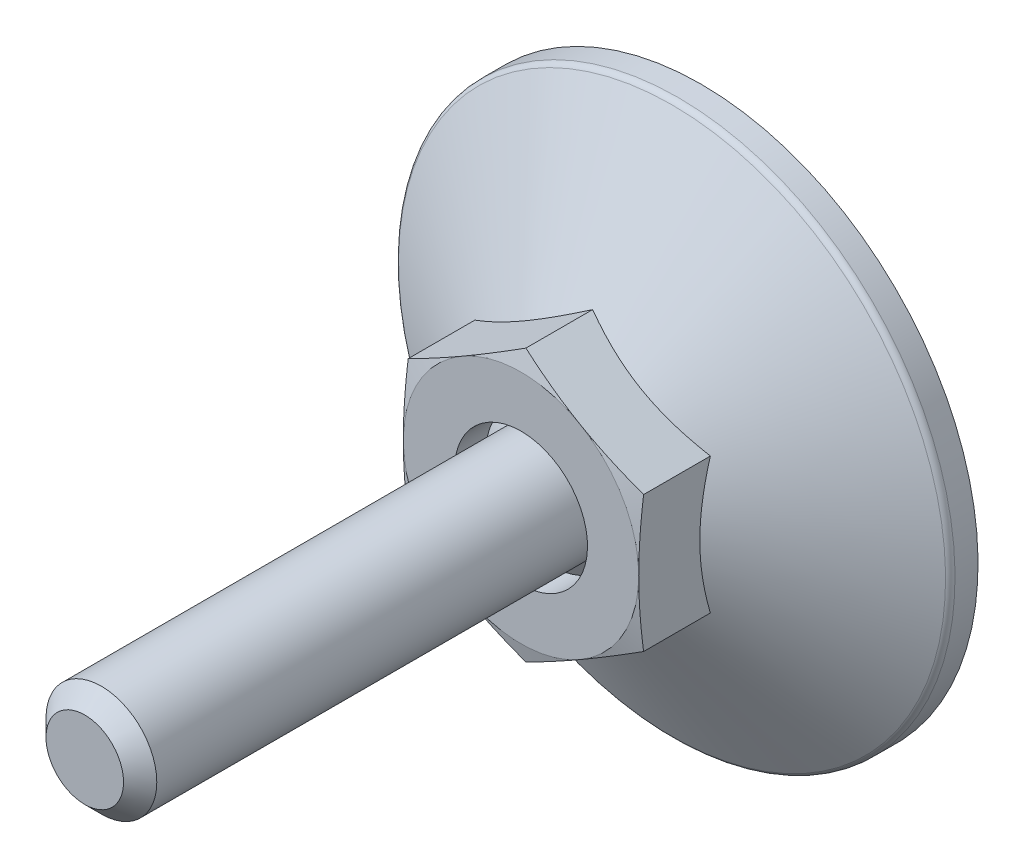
ISO-10303-21;
HEADER;
FILE_DESCRIPTION(('STEP AP214'),'2;1');
FILE_NAME('part.step','',(''),(''),'','','');
FILE_SCHEMA(('AUTOMOTIVE_DESIGN { 1 0 10303 214 1 1 1 1 }'));
ENDSEC;
DATA;
#1=APPLICATION_CONTEXT('core data for automotive mechanical design processes');
#2=APPLICATION_PROTOCOL_DEFINITION('international standard','automotive_design',2000,#1);
#3=PRODUCT_CONTEXT('',#1,'mechanical');
#4=PRODUCT('Part','Part','',(#3));
#5=PRODUCT_RELATED_PRODUCT_CATEGORY('part','',(#4));
#6=PRODUCT_DEFINITION_FORMATION('','',#4);
#7=PRODUCT_DEFINITION_CONTEXT('part definition',#1,'design');
#8=PRODUCT_DEFINITION('design','',#6,#7);
#9=PRODUCT_DEFINITION_SHAPE('','',#8);
#10=(LENGTH_UNIT() NAMED_UNIT(*) SI_UNIT(.MILLI.,.METRE.));
#11=(NAMED_UNIT(*) PLANE_ANGLE_UNIT() SI_UNIT($,.RADIAN.));
#12=(NAMED_UNIT(*) SI_UNIT($,.STERADIAN.) SOLID_ANGLE_UNIT());
#13=UNCERTAINTY_MEASURE_WITH_UNIT(LENGTH_MEASURE(1.E-05),#10,'distance_accuracy_value','');
#14=(GEOMETRIC_REPRESENTATION_CONTEXT(3) GLOBAL_UNCERTAINTY_ASSIGNED_CONTEXT((#13)) GLOBAL_UNIT_ASSIGNED_CONTEXT((#10,
#11,#12)) REPRESENTATION_CONTEXT('',''));
#15=CARTESIAN_POINT('',(0.,0.,0.));
#16=DIRECTION('',(0.,0.,1.));
#17=DIRECTION('',(1.,0.,0.));
#18=AXIS2_PLACEMENT_3D('',#15,#16,#17);
#19=CARTESIAN_POINT('',(0.,0.,0.));
#20=DIRECTION('',(0.,0.,-1.));
#21=DIRECTION('',(0.,1.,0.));
#22=AXIS2_PLACEMENT_3D('',#19,#20,#21);
#23=CYLINDRICAL_SURFACE('',#22,4.);
#24=CARTESIAN_POINT('',(0.,0.,43.3));
#25=DIRECTION('',(0.,0.,1.));
#26=DIRECTION('',(0.,-1.,0.));
#27=AXIS2_PLACEMENT_3D('',#24,#25,#26);
#28=CIRCLE('',#27,4.);
#29=CARTESIAN_POINT('',(0.,-4.,43.3));
#30=VERTEX_POINT('',#29);
#31=EDGE_CURVE('E9',#30,#30,#28,.F.);
#32=ORIENTED_EDGE('',*,*,#31,.T.);
#33=EDGE_LOOP('',(#32));
#34=FACE_BOUND('',#33,.T.);
#35=CARTESIAN_POINT('',(0.,0.,11.187604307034));
#36=DIRECTION('',(0.,0.,-1.));
#37=DIRECTION('',(0.,1.,0.));
#38=AXIS2_PLACEMENT_3D('',#35,#36,#37);
#39=CIRCLE('',#38,4.);
#40=CARTESIAN_POINT('',(0.,4.,11.187604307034));
#41=VERTEX_POINT('',#40);
#42=EDGE_CURVE('E180',#41,#41,#39,.F.);
#43=ORIENTED_EDGE('',*,*,#42,.T.);
#44=EDGE_LOOP('',(#43));
#45=FACE_BOUND('',#44,.T.);
#46=ADVANCED_FACE('F14',(#34,#45),#23,.T.);
#47=CARTESIAN_POINT('',(10.2,0.,0.));
#48=DIRECTION('',(0.,0.,1.));
#49=DIRECTION('',(0.,-1.,0.));
#50=AXIS2_PLACEMENT_3D('',#47,#48,#49);
#51=PLANE('',#50);
#52=DIRECTION('',(1.,0.,0.));
#53=VECTOR('',#52,1.);
#54=CARTESIAN_POINT('',(1.,-1.,0.));
#55=LINE('',#54,#53);
#56=CARTESIAN_POINT('',(1.,-1.,0.));
#57=VERTEX_POINT('',#56);
#58=CARTESIAN_POINT('',(6.66666666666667,-1.,0.));
#59=VERTEX_POINT('',#58);
#60=EDGE_CURVE('E706',#57,#59,#55,.T.);
#61=ORIENTED_EDGE('',*,*,#60,.T.);
#62=DIRECTION('',(0.,-1.,0.));
#63=VECTOR('',#62,1.);
#64=CARTESIAN_POINT('',(6.66666666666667,0.,0.));
#65=LINE('',#64,#63);
#66=CARTESIAN_POINT('',(6.66666666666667,1.,0.));
#67=VERTEX_POINT('',#66);
#68=EDGE_CURVE('E379',#67,#59,#65,.T.);
#69=ORIENTED_EDGE('',*,*,#68,.F.);
#70=DIRECTION('',(-1.,0.,0.));
#71=VECTOR('',#70,1.);
#72=CARTESIAN_POINT('',(6.66666666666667,1.,0.));
#73=LINE('',#72,#71);
#74=CARTESIAN_POINT('',(1.,1.,0.));
#75=VERTEX_POINT('',#74);
#76=EDGE_CURVE('E665',#67,#75,#73,.T.);
#77=ORIENTED_EDGE('',*,*,#76,.T.);
#78=DIRECTION('',(0.,1.,0.));
#79=VECTOR('',#78,1.);
#80=CARTESIAN_POINT('',(1.,1.,0.));
#81=LINE('',#80,#79);
#82=CARTESIAN_POINT('',(1.,6.66666666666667,0.));
#83=VERTEX_POINT('',#82);
#84=EDGE_CURVE('E662',#75,#83,#81,.T.);
#85=ORIENTED_EDGE('',*,*,#84,.T.);
#86=DIRECTION('',(-1.,0.,0.));
#87=VECTOR('',#86,1.);
#88=CARTESIAN_POINT('',(1.,6.66666666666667,0.));
#89=LINE('',#88,#87);
#90=CARTESIAN_POINT('',(-1.,6.66666666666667,0.));
#91=VERTEX_POINT('',#90);
#92=EDGE_CURVE('E655',#83,#91,#89,.T.);
#93=ORIENTED_EDGE('',*,*,#92,.T.);
#94=DIRECTION('',(0.,-1.,0.));
#95=VECTOR('',#94,1.);
#96=CARTESIAN_POINT('',(-1.,6.66666666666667,0.));
#97=LINE('',#96,#95);
#98=CARTESIAN_POINT('',(-1.,1.,0.));
#99=VERTEX_POINT('',#98);
#100=EDGE_CURVE('E175',#91,#99,#97,.T.);
#101=ORIENTED_EDGE('',*,*,#100,.T.);
#102=DIRECTION('',(-1.,0.,0.));
#103=VECTOR('',#102,1.);
#104=CARTESIAN_POINT('',(-1.,1.,0.));
#105=LINE('',#104,#103);
#106=CARTESIAN_POINT('',(-6.66666666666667,1.,0.));
#107=VERTEX_POINT('',#106);
#108=EDGE_CURVE('E29',#99,#107,#105,.T.);
#109=ORIENTED_EDGE('',*,*,#108,.T.);
#110=DIRECTION('',(0.,-1.,0.));
#111=VECTOR('',#110,1.);
#112=CARTESIAN_POINT('',(-6.66666666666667,1.,0.));
#113=LINE('',#112,#111);
#114=CARTESIAN_POINT('',(-6.66666666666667,-1.,0.));
#115=VERTEX_POINT('',#114);
#116=EDGE_CURVE('E179',#107,#115,#113,.T.);
#117=ORIENTED_EDGE('',*,*,#116,.T.);
#118=DIRECTION('',(1.,0.,0.));
#119=VECTOR('',#118,1.);
#120=CARTESIAN_POINT('',(-6.66666666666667,-1.,0.));
#121=LINE('',#120,#119);
#122=CARTESIAN_POINT('',(-1.,-1.,0.));
#123=VERTEX_POINT('',#122);
#124=EDGE_CURVE('E690',#115,#123,#121,.T.);
#125=ORIENTED_EDGE('',*,*,#124,.T.);
#126=DIRECTION('',(0.,-1.,0.));
#127=VECTOR('',#126,1.);
#128=CARTESIAN_POINT('',(-1.,-1.,0.));
#129=LINE('',#128,#127);
#130=CARTESIAN_POINT('',(-1.,-6.66666666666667,0.));
#131=VERTEX_POINT('',#130);
#132=EDGE_CURVE('E692',#123,#131,#129,.T.);
#133=ORIENTED_EDGE('',*,*,#132,.T.);
#134=DIRECTION('',(1.,0.,0.));
#135=VECTOR('',#134,1.);
#136=CARTESIAN_POINT('',(-1.,-6.66666666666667,0.));
#137=LINE('',#136,#135);
#138=CARTESIAN_POINT('',(1.,-6.66666666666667,0.));
#139=VERTEX_POINT('',#138);
#140=EDGE_CURVE('E696',#131,#139,#137,.T.);
#141=ORIENTED_EDGE('',*,*,#140,.T.);
#142=DIRECTION('',(0.,1.,0.));
#143=VECTOR('',#142,1.);
#144=CARTESIAN_POINT('',(1.,-6.66666666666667,0.));
#145=LINE('',#144,#143);
#146=EDGE_CURVE('E703',#139,#57,#145,.T.);
#147=ORIENTED_EDGE('',*,*,#146,.T.);
#148=EDGE_LOOP('',(#61,#69,#77,#85,#93,#101,#109,#117,#125,#133,#141,#147));
#149=FACE_BOUND('',#148,.T.);
#150=CARTESIAN_POINT('',(0.,0.,0.));
#151=DIRECTION('',(0.,0.,-1.));
#152=DIRECTION('',(0.,1.,0.));
#153=AXIS2_PLACEMENT_3D('',#150,#151,#152);
#154=CIRCLE('',#153,20.);
#155=CARTESIAN_POINT('',(0.,20.,0.));
#156=VERTEX_POINT('',#155);
#157=EDGE_CURVE('E184',#156,#156,#154,.T.);
#158=ORIENTED_EDGE('',*,*,#157,.T.);
#159=EDGE_LOOP('',(#158));
#160=FACE_BOUND('',#159,.T.);
#161=ADVANCED_FACE('F223',(#149,#160),#51,.F.);
#162=CARTESIAN_POINT('',(0.,0.,13.4970053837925));
#163=DIRECTION('',(0.,0.,-1.));
#164=DIRECTION('',(0.,1.,0.));
#165=AXIS2_PLACEMENT_3D('',#162,#163,#164);
#166=CONICAL_SURFACE('',#165,0.,1.0471975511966);
#167=CARTESIAN_POINT('',(0.,0.,10.7257240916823));
#168=DIRECTION('',(0.,0.,-1.));
#169=DIRECTION('',(0.,1.,0.));
#170=AXIS2_PLACEMENT_3D('',#167,#168,#169);
#171=CIRCLE('',#170,4.8);
#172=CARTESIAN_POINT('',(0.,4.8,10.7257240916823));
#173=VERTEX_POINT('',#172);
#174=EDGE_CURVE('E423',#173,#173,#171,.F.);
#175=ORIENTED_EDGE('',*,*,#174,.T.);
#176=EDGE_LOOP('',(#175));
#177=FACE_BOUND('',#176,.T.);
#178=ORIENTED_EDGE('',*,*,#42,.F.);
#179=EDGE_LOOP('',(#178));
#180=FACE_BOUND('',#179,.T.);
#181=ADVANCED_FACE('F217',(#177,#180),#166,.T.);
#182=CARTESIAN_POINT('',(0.,0.,0.));
#183=DIRECTION('',(0.,0.,-1.));
#184=DIRECTION('',(0.,1.,0.));
#185=AXIS2_PLACEMENT_3D('',#182,#183,#184);
#186=CYLINDRICAL_SURFACE('',#185,4.8);
#187=CARTESIAN_POINT('',(0.,0.,13.));
#188=DIRECTION('',(0.,0.,-1.));
#189=DIRECTION('',(0.,1.,0.));
#190=AXIS2_PLACEMENT_3D('',#187,#188,#189);
#191=CIRCLE('',#190,4.8);
#192=CARTESIAN_POINT('',(0.,4.8,13.));
#193=VERTEX_POINT('',#192);
#194=EDGE_CURVE('E380',#193,#193,#191,.T.);
#195=ORIENTED_EDGE('',*,*,#194,.F.);
#196=EDGE_LOOP('',(#195));
#197=FACE_BOUND('',#196,.T.);
#198=ORIENTED_EDGE('',*,*,#174,.F.);
#199=EDGE_LOOP('',(#198));
#200=FACE_BOUND('',#199,.T.);
#201=ADVANCED_FACE('F222',(#197,#200),#186,.F.);
#202=CARTESIAN_POINT('',(0.,9.81495457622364,99.));
#203=DIRECTION('',(0.5,-0.866025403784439,0.));
#204=DIRECTION('',(0.866025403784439,0.5,0.));
#205=AXIS2_PLACEMENT_3D('',#202,#203,#204);
#206=PLANE('',#205);
#207=CARTESIAN_POINT('',(-8.5002,4.90736181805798,7.83027204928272));
#208=CARTESIAN_POINT('',(-8.31336077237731,5.01523349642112,7.89254195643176));
#209=CARTESIAN_POINT('',(-8.1258249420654,5.1235073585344,7.95198579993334));
#210=CARTESIAN_POINT('',(-7.74923024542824,5.34093440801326,8.06444298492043));
#211=CARTESIAN_POINT('',(-7.56017075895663,5.45008795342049,8.1174535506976));
#212=CARTESIAN_POINT('',(-6.9899652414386,5.77929626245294,8.26579470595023));
#213=CARTESIAN_POINT('',(-6.60656835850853,6.00065055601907,8.3501691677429));
#214=CARTESIAN_POINT('',(-6.03282233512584,6.33190297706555,8.44910807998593));
#215=CARTESIAN_POINT('',(-5.84418723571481,6.44081150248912,8.47729289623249));
#216=CARTESIAN_POINT('',(-5.46606397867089,6.65912106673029,8.52455401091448));
#217=CARTESIAN_POINT('',(-5.27657589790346,6.76852206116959,8.54363111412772));
#218=CARTESIAN_POINT('',(-4.8972734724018,6.98751241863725,8.57219332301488));
#219=CARTESIAN_POINT('',(-4.7074597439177,7.09710142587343,8.58168931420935));
#220=CARTESIAN_POINT('',(-4.32765694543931,7.3163806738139,8.59088571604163));
#221=CARTESIAN_POINT('',(-4.13766788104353,7.42607091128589,8.59058642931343));
#222=CARTESIAN_POINT('',(-3.78247698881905,7.63114046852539,8.58087362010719));
#223=CARTESIAN_POINT('',(-3.6172500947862,7.72653426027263,8.57264492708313));
#224=CARTESIAN_POINT('',(-3.28718328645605,7.9170984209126,8.54893885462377));
#225=CARTESIAN_POINT('',(-3.12234339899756,8.01226877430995,8.53346098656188));
#226=CARTESIAN_POINT('',(-2.62846189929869,8.29741139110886,8.47651947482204));
#227=CARTESIAN_POINT('',(-2.30029449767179,8.48687892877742,8.42455503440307));
#228=CARTESIAN_POINT('',(-1.64047857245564,8.86782383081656,8.29464315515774));
#229=CARTESIAN_POINT('',(-1.30891425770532,9.05925257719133,8.21614502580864));
#230=CARTESIAN_POINT('',(-0.650730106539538,9.43925537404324,8.03798675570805));
#231=CARTESIAN_POINT('',(-0.324101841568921,9.62783429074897,7.93836845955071));
#232=CARTESIAN_POINT('',(0.000199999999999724,9.81507004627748,7.83027204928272));
#233=B_SPLINE_CURVE_WITH_KNOTS('',3,(#207,#208,#209,#210,#211,#212,#213,#214,#215,#216,#217,
#218,#219,#220,#221,#222,#223,#224,#225,#226,#227,#228,#229,#230,#231,#232),.UNSPECIFIED.,.F.,
.F.,(4,2,2,2,2,2,2,2,2,2,2,2,4),(0.,0.673596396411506,1.34748239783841,2.69805431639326,
3.356799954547,4.01548737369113,4.67342558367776,5.33134346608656,5.90409556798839,
6.47688628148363,7.62328361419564,8.79510569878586,9.9646274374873),.UNSPECIFIED.);
#234=CARTESIAN_POINT('',(-8.5,4.90747728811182,7.83033871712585));
#235=VERTEX_POINT('',#234);
#236=CARTESIAN_POINT('',(0.,9.81495457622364,7.83033871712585));
#237=VERTEX_POINT('',#236);
#238=EDGE_CURVE('E256',#235,#237,#233,.T.);
#239=ORIENTED_EDGE('',*,*,#238,.F.);
#240=DIRECTION('',(0.,0.,-1.));
#241=VECTOR('',#240,1.);
#242=CARTESIAN_POINT('',(-8.5,4.90747728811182,99.));
#243=LINE('',#242,#241);
#244=CARTESIAN_POINT('',(-8.5,4.90747728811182,12.6476589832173));
#245=VERTEX_POINT('',#244);
#246=EDGE_CURVE('E431',#245,#235,#243,.T.);
#247=ORIENTED_EDGE('',*,*,#246,.F.);
#248=CARTESIAN_POINT('',(0.000200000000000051,9.81507004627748,12.6476280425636));
#249=CARTESIAN_POINT('',(-0.352800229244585,9.61126526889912,12.7022599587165));
#250=CARTESIAN_POINT('',(-0.706440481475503,9.40709097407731,12.7518566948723));
#251=CARTESIAN_POINT('',(-1.41496987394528,8.99802133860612,12.8389934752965));
#252=CARTESIAN_POINT('',(-1.76985946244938,8.79312573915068,12.8765286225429));
#253=CARTESIAN_POINT('',(-2.47873586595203,8.38385575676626,12.9373509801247));
#254=CARTESIAN_POINT('',(-2.83271788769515,8.17948414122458,12.9607107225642));
#255=CARTESIAN_POINT('',(-3.5411333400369,7.77048028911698,12.9920337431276));
#256=CARTESIAN_POINT('',(-3.89556667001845,7.56584811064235,13.));
#257=CARTESIAN_POINT('',(-4.60443332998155,7.15658375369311,13.));
#258=CARTESIAN_POINT('',(-4.9588666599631,6.95195157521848,12.9920337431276));
#259=CARTESIAN_POINT('',(-5.66728211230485,6.54294772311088,12.9607107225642));
#260=CARTESIAN_POINT('',(-6.02126413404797,6.33857610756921,12.9373509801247));
#261=CARTESIAN_POINT('',(-6.73014053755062,5.92930612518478,12.8765286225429));
#262=CARTESIAN_POINT('',(-7.08503012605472,5.72441052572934,12.8389934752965));
#263=CARTESIAN_POINT('',(-7.7935595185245,5.31534089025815,12.7518566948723));
#264=CARTESIAN_POINT('',(-8.14719977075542,5.11116659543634,12.7022599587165));
#265=CARTESIAN_POINT('',(-8.5002,4.90736181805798,12.6476280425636));
#266=B_SPLINE_CURVE_WITH_KNOTS('',3,(#248,#249,#250,#251,#252,#253,#254,#255,#256,#257,#258,
#259,#260,#261,#262,#263,#264,#265),.UNSPECIFIED.,.F.,.F.,(4,2,2,2,2,2,2,2,4),(0.,
1.23382789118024,2.46815608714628,3.69611406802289,4.92383440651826,6.15155474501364,
7.37951272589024,8.61384092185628,9.84766881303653),.UNSPECIFIED.);
#267=CARTESIAN_POINT('',(-4.25,7.36121593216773,13.));
#268=VERTEX_POINT('',#267);
#269=EDGE_CURVE('E286',#268,#245,#266,.T.);
#270=ORIENTED_EDGE('',*,*,#269,.F.);
#271=CARTESIAN_POINT('',(0.,9.81495457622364,12.6476589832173));
#272=VERTEX_POINT('',#271);
#273=EDGE_CURVE('E395',#272,#268,#266,.T.);
#274=ORIENTED_EDGE('',*,*,#273,.F.);
#275=DIRECTION('',(0.,0.,-1.));
#276=VECTOR('',#275,1.);
#277=CARTESIAN_POINT('',(0.,9.81495457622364,99.));
#278=LINE('',#277,#276);
#279=EDGE_CURVE('E415',#272,#237,#278,.T.);
#280=ORIENTED_EDGE('',*,*,#279,.T.);
#281=EDGE_LOOP('',(#239,#247,#270,#274,#280));
#282=FACE_BOUND('',#281,.T.);
#283=ADVANCED_FACE('F228',(#282),#206,.F.);
#284=CARTESIAN_POINT('',(8.5,4.90747728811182,99.));
#285=DIRECTION('',(-0.5,-0.866025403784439,0.));
#286=DIRECTION('',(0.866025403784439,-0.5,0.));
#287=AXIS2_PLACEMENT_3D('',#284,#285,#286);
#288=PLANE('',#287);
#289=CARTESIAN_POINT('',(-0.0002,9.81507004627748,7.83027204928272));
#290=CARTESIAN_POINT('',(0.186639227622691,9.70719836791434,7.89254195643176));
#291=CARTESIAN_POINT('',(0.374175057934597,9.59892450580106,7.95198579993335));
#292=CARTESIAN_POINT('',(0.750769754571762,9.3814974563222,8.06444298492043));
#293=CARTESIAN_POINT('',(0.939829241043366,9.27234391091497,8.1174535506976));
#294=CARTESIAN_POINT('',(1.5100347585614,8.94313560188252,8.26579470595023));
#295=CARTESIAN_POINT('',(1.89343164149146,8.72178130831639,8.3501691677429));
#296=CARTESIAN_POINT('',(2.46717766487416,8.39052888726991,8.44910807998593));
#297=CARTESIAN_POINT('',(2.65581276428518,8.28162036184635,8.47729289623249));
#298=CARTESIAN_POINT('',(3.03393602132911,8.06331079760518,8.52455401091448));
#299=CARTESIAN_POINT('',(3.22342410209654,7.95390980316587,8.54363111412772));
#300=CARTESIAN_POINT('',(3.6027265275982,7.73491944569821,8.57219332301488));
#301=CARTESIAN_POINT('',(3.79254025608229,7.62533043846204,8.58168931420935));
#302=CARTESIAN_POINT('',(4.17234305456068,7.40605119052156,8.59088571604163));
#303=CARTESIAN_POINT('',(4.36233211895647,7.29636095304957,8.59058642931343));
#304=CARTESIAN_POINT('',(4.71752301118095,7.09129139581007,8.58087362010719));
#305=CARTESIAN_POINT('',(4.8827499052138,6.99589760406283,8.57264492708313));
#306=CARTESIAN_POINT('',(5.21281671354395,6.80533344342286,8.54893885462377));
#307=CARTESIAN_POINT('',(5.37765660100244,6.71016309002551,8.53346098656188));
#308=CARTESIAN_POINT('',(5.87153810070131,6.42502047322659,8.47651947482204));
#309=CARTESIAN_POINT('',(6.19970550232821,6.23555293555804,8.42455503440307));
#310=CARTESIAN_POINT('',(6.85952142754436,5.8546080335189,8.29464315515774));
#311=CARTESIAN_POINT('',(7.19108574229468,5.66317928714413,8.21614502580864));
#312=CARTESIAN_POINT('',(7.84926989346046,5.28317649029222,8.03798675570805));
#313=CARTESIAN_POINT('',(8.17589815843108,5.09459757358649,7.93836845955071));
#314=CARTESIAN_POINT('',(8.5002,4.90736181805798,7.83027204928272));
#315=B_SPLINE_CURVE_WITH_KNOTS('',3,(#289,#290,#291,#292,#293,#294,#295,#296,#297,#298,#299,
#300,#301,#302,#303,#304,#305,#306,#307,#308,#309,#310,#311,#312,#313,#314),.UNSPECIFIED.,.F.,
.F.,(4,2,2,2,2,2,2,2,2,2,2,2,4),(0.,0.673596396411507,1.34748239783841,2.69805431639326,
3.35679995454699,4.01548737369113,4.67342558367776,5.33134346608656,5.90409556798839,
6.47688628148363,7.62328361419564,8.79510569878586,9.9646274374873),.UNSPECIFIED.);
#316=CARTESIAN_POINT('',(8.5,4.90747728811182,7.83033871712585));
#317=VERTEX_POINT('',#316);
#318=EDGE_CURVE('E37',#237,#317,#315,.T.);
#319=ORIENTED_EDGE('',*,*,#318,.F.);
#320=ORIENTED_EDGE('',*,*,#279,.F.);
#321=CARTESIAN_POINT('',(8.5002,4.90736181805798,12.6476280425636));
#322=CARTESIAN_POINT('',(8.14719977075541,5.11116659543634,12.7022599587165));
#323=CARTESIAN_POINT('',(7.7935595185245,5.31534089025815,12.7518566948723));
#324=CARTESIAN_POINT('',(7.08503012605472,5.72441052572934,12.8389934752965));
#325=CARTESIAN_POINT('',(6.73014053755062,5.92930612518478,12.8765286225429));
#326=CARTESIAN_POINT('',(6.02126413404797,6.33857610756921,12.9373509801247));
#327=CARTESIAN_POINT('',(5.66728211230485,6.54294772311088,12.9607107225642));
#328=CARTESIAN_POINT('',(4.9588666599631,6.95195157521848,12.9920337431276));
#329=CARTESIAN_POINT('',(4.60443332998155,7.15658375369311,13.));
#330=CARTESIAN_POINT('',(3.89556667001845,7.56584811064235,13.));
#331=CARTESIAN_POINT('',(3.5411333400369,7.77048028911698,12.9920337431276));
#332=CARTESIAN_POINT('',(2.83271788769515,8.17948414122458,12.9607107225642));
#333=CARTESIAN_POINT('',(2.47873586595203,8.38385575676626,12.9373509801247));
#334=CARTESIAN_POINT('',(1.76985946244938,8.79312573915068,12.8765286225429));
#335=CARTESIAN_POINT('',(1.41496987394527,8.99802133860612,12.8389934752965));
#336=CARTESIAN_POINT('',(0.7064404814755,9.40709097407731,12.7518566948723));
#337=CARTESIAN_POINT('',(0.352800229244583,9.61126526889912,12.7022599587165));
#338=CARTESIAN_POINT('',(-0.000200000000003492,9.81507004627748,12.6476280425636));
#339=B_SPLINE_CURVE_WITH_KNOTS('',3,(#321,#322,#323,#324,#325,#326,#327,#328,#329,#330,#331,
#332,#333,#334,#335,#336,#337,#338),.UNSPECIFIED.,.F.,.F.,(4,2,2,2,2,2,2,2,4),(0.,
1.23382789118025,2.46815608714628,3.69611406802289,4.92383440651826,6.15155474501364,
7.37951272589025,8.61384092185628,9.84766881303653),.UNSPECIFIED.);
#340=CARTESIAN_POINT('',(4.25,7.36121593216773,13.));
#341=VERTEX_POINT('',#340);
#342=EDGE_CURVE('E269',#341,#272,#339,.T.);
#343=ORIENTED_EDGE('',*,*,#342,.F.);
#344=CARTESIAN_POINT('',(8.5,4.90747728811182,12.6476589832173));
#345=VERTEX_POINT('',#344);
#346=EDGE_CURVE('E278',#345,#341,#339,.T.);
#347=ORIENTED_EDGE('',*,*,#346,.F.);
#348=DIRECTION('',(0.,0.,-1.));
#349=VECTOR('',#348,1.);
#350=CARTESIAN_POINT('',(8.5,4.90747728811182,99.));
#351=LINE('',#350,#349);
#352=EDGE_CURVE('E417',#345,#317,#351,.T.);
#353=ORIENTED_EDGE('',*,*,#352,.T.);
#354=EDGE_LOOP('',(#319,#320,#343,#347,#353));
#355=FACE_BOUND('',#354,.T.);
#356=ADVANCED_FACE('F262',(#355),#288,.F.);
#357=CARTESIAN_POINT('',(8.5,-4.90747728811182,99.));
#358=DIRECTION('',(-1.,0.,0.));
#359=DIRECTION('',(0.,-1.,0.));
#360=AXIS2_PLACEMENT_3D('',#357,#358,#359);
#361=PLANE('',#360);
#362=CARTESIAN_POINT('',(8.5,12.8220542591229,4.61528116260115));
#363=CARTESIAN_POINT('',(8.5,12.4534155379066,4.79262377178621));
#364=CARTESIAN_POINT('',(8.5,12.0838902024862,4.96815716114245));
#365=CARTESIAN_POINT('',(8.5,11.3425927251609,5.31457894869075));
#366=CARTESIAN_POINT('',(8.5,10.9708202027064,5.48546653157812));
#367=CARTESIAN_POINT('',(8.5,10.2224625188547,5.82250763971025));
#368=CARTESIAN_POINT('',(8.5,9.84586188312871,5.98862693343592));
#369=CARTESIAN_POINT('',(8.5,9.08953299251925,6.31355867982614));
#370=CARTESIAN_POINT('',(8.5,8.70980489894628,6.47237150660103));
#371=CARTESIAN_POINT('',(8.5,7.93635853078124,6.78489169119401));
#372=CARTESIAN_POINT('',(8.5,7.5425381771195,6.93834789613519));
#373=CARTESIAN_POINT('',(8.5,6.75016193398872,7.23275009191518));
#374=CARTESIAN_POINT('',(8.5,6.35160550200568,7.37369463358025));
#375=CARTESIAN_POINT('',(8.5,5.54998630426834,7.63911020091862));
#376=CARTESIAN_POINT('',(8.5,5.14693580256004,7.76361784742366));
#377=CARTESIAN_POINT('',(8.5,4.33508769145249,7.99193558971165));
#378=CARTESIAN_POINT('',(8.5,3.92629204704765,8.09575258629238));
#379=CARTESIAN_POINT('',(8.5,3.10458766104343,8.27700176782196));
#380=CARTESIAN_POINT('',(8.5,2.69170444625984,8.35454642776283));
#381=CARTESIAN_POINT('',(8.5,2.06892742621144,8.44757828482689));
#382=CARTESIAN_POINT('',(8.5,1.86074253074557,8.47470931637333));
#383=CARTESIAN_POINT('',(8.5,1.44346514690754,8.52067173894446));
#384=CARTESIAN_POINT('',(8.5,1.23437274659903,8.5395039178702));
#385=CARTESIAN_POINT('',(8.5,0.818123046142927,8.5682751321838));
#386=CARTESIAN_POINT('',(8.5,0.6109730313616,8.57831925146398));
#387=CARTESIAN_POINT('',(8.5,0.196434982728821,8.58967320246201));
#388=CARTESIAN_POINT('',(8.5,-0.0109530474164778,8.59098316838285));
#389=CARTESIAN_POINT('',(8.5,-0.425608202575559,8.58483724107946));
#390=CARTESIAN_POINT('',(8.5,-0.632875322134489,8.57738097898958));
#391=CARTESIAN_POINT('',(8.5,-1.04692490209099,8.55387613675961));
#392=CARTESIAN_POINT('',(8.5,-1.25370733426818,8.5378270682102));
#393=CARTESIAN_POINT('',(8.5,-1.76172684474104,8.48816674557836));
#394=CARTESIAN_POINT('',(8.5,-2.06251418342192,8.44986872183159));
#395=CARTESIAN_POINT('',(8.5,-2.66160170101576,8.35726697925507));
#396=CARTESIAN_POINT('',(8.5,-2.95990148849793,8.30296078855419));
#397=CARTESIAN_POINT('',(8.5,-3.85084347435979,8.11893322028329));
#398=CARTESIAN_POINT('',(8.5,-4.4391769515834,7.96814146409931));
#399=CARTESIAN_POINT('',(8.5,-5.31919968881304,7.70971639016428));
#400=CARTESIAN_POINT('',(8.5,-5.61551051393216,7.61694416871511));
#401=CARTESIAN_POINT('',(8.5,-6.20524874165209,7.4225646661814));
#402=CARTESIAN_POINT('',(8.5,-6.4986761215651,7.3209573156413));
#403=CARTESIAN_POINT('',(8.5,-7.08276471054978,7.11046965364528));
#404=CARTESIAN_POINT('',(8.5,-7.37342689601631,7.0015920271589));
#405=CARTESIAN_POINT('',(8.5,-7.95239195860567,6.77777126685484));
#406=CARTESIAN_POINT('',(8.5,-8.2406948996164,6.66282829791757));
#407=CARTESIAN_POINT('',(8.5,-8.80562449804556,6.43181846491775));
#408=CARTESIAN_POINT('',(8.5,-9.08231928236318,6.31591764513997));
#409=CARTESIAN_POINT('',(8.5,-9.63401072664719,6.0801365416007));
#410=CARTESIAN_POINT('',(8.5,-9.90900735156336,5.96025617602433));
#411=CARTESIAN_POINT('',(8.5,-10.7318217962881,5.59557173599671));
#412=CARTESIAN_POINT('',(8.5,-11.2774137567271,5.34574521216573));
#413=CARTESIAN_POINT('',(8.5,-12.3642460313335,4.83628492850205));
#414=CARTESIAN_POINT('',(8.5,-12.905484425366,4.57664710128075));
#415=CARTESIAN_POINT('',(8.5,-13.9843891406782,4.05013469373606));
#416=CARTESIAN_POINT('',(8.5,-14.5220556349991,3.78326046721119));
#417=CARTESIAN_POINT('',(8.5,-15.5954930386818,3.24355438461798));
#418=CARTESIAN_POINT('',(8.5,-16.1312593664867,2.97071343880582));
#419=CARTESIAN_POINT('',(8.5,-17.2005865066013,2.4207361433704));
#420=CARTESIAN_POINT('',(8.5,-17.7341472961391,2.14359974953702));
#421=CARTESIAN_POINT('',(8.5,-18.7993643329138,1.58600707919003));
#422=CARTESIAN_POINT('',(8.5,-19.3310210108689,1.30555162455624));
#423=CARTESIAN_POINT('',(8.5,-20.3928917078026,0.741921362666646));
#424=CARTESIAN_POINT('',(8.5,-20.9231057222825,0.458746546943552));
#425=CARTESIAN_POINT('',(8.5,-22.3874236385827,-0.32722037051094));
#426=CARTESIAN_POINT('',(8.5,-23.3202800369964,-0.83233607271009));
#427=CARTESIAN_POINT('',(8.5,-25.1833983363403,-1.84747335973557));
#428=CARTESIAN_POINT('',(8.5,-26.1136600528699,-2.35749528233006));
#429=CARTESIAN_POINT('',(8.5,-27.9692131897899,-3.37950461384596));
#430=CARTESIAN_POINT('',(8.5,-28.8945109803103,-3.89148046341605));
#431=CARTESIAN_POINT('',(8.5,-30.2812847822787,-4.66146611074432));
#432=CARTESIAN_POINT('',(8.5,-30.7433285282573,-4.91845451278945));
#433=CARTESIAN_POINT('',(8.5,-31.6670795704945,-5.43303439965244));
#434=CARTESIAN_POINT('',(8.5,-32.1287868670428,-5.69062588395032));
#435=CARTESIAN_POINT('',(8.5,-32.5903473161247,-5.94848028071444));
#436=B_SPLINE_CURVE_WITH_KNOTS('',3,(#362,#363,#364,#365,#366,#367,#368,#369,#370,#371,#372,
#373,#374,#375,#376,#377,#378,#379,#380,#381,#382,#383,#384,#385,#386,#387,#388,#389,#390,#391,
#392,#393,#394,#395,#396,#397,#398,#399,#400,#401,#402,#403,#404,#405,#406,#407,#408,#409,#410,
#411,#412,#413,#414,#415,#416,#417,#418,#419,#420,#421,#422,#423,#424,#425,#426,#427,#428,#429,
#430,#431,#432,#433,#434,#435),.UNSPECIFIED.,.F.,.F.,(4,2,2,2,2,2,2,2,2,2,2,2,2,2,2,2,2,2,2,2,2,
2,2,2,2,2,2,2,2,2,2,2,2,2,2,2,4),(0.,1.22725127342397,2.45471654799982,3.68948778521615,
4.92419572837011,6.19201746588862,7.45998585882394,8.72507978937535,9.98975107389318,
11.2489376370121,11.878634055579,12.5082706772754,13.1302712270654,13.7522622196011,
14.3742793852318,14.9963319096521,15.9054589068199,16.814726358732,18.6343169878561,
19.5657329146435,20.4971561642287,21.4282373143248,22.3592931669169,23.259222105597,
24.1591695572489,25.9592281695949,27.7600413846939,29.5607667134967,31.3644583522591,
33.1681685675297,34.9714411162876,36.7747192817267,39.9571898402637,43.1398810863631,
46.3123590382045,47.8984694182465,49.4845784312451),.UNSPECIFIED.);
#437=CARTESIAN_POINT('',(8.5,-4.90747728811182,7.83033871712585));
#438=VERTEX_POINT('',#437);
#439=EDGE_CURVE('E245',#317,#438,#436,.T.);
#440=ORIENTED_EDGE('',*,*,#439,.F.);
#441=ORIENTED_EDGE('',*,*,#352,.F.);
#442=CARTESIAN_POINT('',(8.5,12.9820891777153,11.1197370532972));
#443=CARTESIAN_POINT('',(8.5,12.5964686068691,11.2061594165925));
#444=CARTESIAN_POINT('',(8.5,12.2106068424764,11.2915248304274));
#445=CARTESIAN_POINT('',(8.5,11.4382824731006,11.4595712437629));
#446=CARTESIAN_POINT('',(8.5,11.0518198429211,11.5422521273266));
#447=CARTESIAN_POINT('',(8.5,10.2778290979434,11.7044309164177));
#448=CARTESIAN_POINT('',(8.5,9.89030030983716,11.7839256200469));
#449=CARTESIAN_POINT('',(8.5,9.11443612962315,11.9388739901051));
#450=CARTESIAN_POINT('',(8.5,8.72610074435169,12.0143276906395));
#451=CARTESIAN_POINT('',(8.5,7.95158013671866,12.159650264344));
#452=CARTESIAN_POINT('',(8.5,7.56540239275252,12.2295587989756));
#453=CARTESIAN_POINT('',(8.5,6.79199352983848,12.3632725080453));
#454=CARTESIAN_POINT('',(8.5,6.40476243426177,12.4270778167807));
#455=CARTESIAN_POINT('',(8.5,5.62917169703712,12.54714843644));
#456=CARTESIAN_POINT('',(8.5,5.24081220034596,12.6034146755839));
#457=CARTESIAN_POINT('',(8.5,4.46285737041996,12.70674908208));
#458=CARTESIAN_POINT('',(8.5,4.07326203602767,12.7538172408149));
#459=CARTESIAN_POINT('',(8.5,3.28844017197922,12.8374226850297));
#460=CARTESIAN_POINT('',(8.5,2.89320002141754,12.8738340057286));
#461=CARTESIAN_POINT('',(8.5,2.10172608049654,12.9336139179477));
#462=CARTESIAN_POINT('',(8.5,1.70549231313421,12.9569828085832));
#463=CARTESIAN_POINT('',(8.5,0.912605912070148,12.9893148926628));
#464=CARTESIAN_POINT('',(8.5,0.515953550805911,12.9982846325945));
#465=CARTESIAN_POINT('',(8.5,-0.27740821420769,13.0012669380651));
#466=CARTESIAN_POINT('',(8.5,-0.674117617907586,12.9952795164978));
#467=CARTESIAN_POINT('',(8.5,-1.46847963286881,12.9686842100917));
#468=CARTESIAN_POINT('',(8.5,-1.86613043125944,12.9480232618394));
#469=CARTESIAN_POINT('',(8.5,-2.66049684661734,12.8932602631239));
#470=CARTESIAN_POINT('',(8.5,-3.05721244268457,12.8591579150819));
#471=CARTESIAN_POINT('',(8.5,-3.84970511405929,12.7792347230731));
#472=CARTESIAN_POINT('',(8.5,-4.24548140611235,12.7334062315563));
#473=CARTESIAN_POINT('',(8.5,-5.03576028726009,12.6319377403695));
#474=CARTESIAN_POINT('',(8.5,-5.43026287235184,12.5762977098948));
#475=CARTESIAN_POINT('',(8.5,-6.19195385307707,12.4609360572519));
#476=CARTESIAN_POINT('',(8.5,-6.55922094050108,12.4017287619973));
#477=CARTESIAN_POINT('',(8.5,-7.29278719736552,12.2775674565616));
#478=CARTESIAN_POINT('',(8.5,-7.65908634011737,12.2126132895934));
#479=CARTESIAN_POINT('',(8.5,-8.39085027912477,12.078008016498));
#480=CARTESIAN_POINT('',(8.5,-8.75631499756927,12.0083564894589));
#481=CARTESIAN_POINT('',(8.5,-9.48649515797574,11.8652200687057));
#482=CARTESIAN_POINT('',(8.5,-9.85121059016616,11.7917351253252));
#483=CARTESIAN_POINT('',(8.5,-10.5800753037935,11.6416087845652));
#484=CARTESIAN_POINT('',(8.5,-10.944224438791,11.5649666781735));
#485=CARTESIAN_POINT('',(8.5,-11.6719684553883,11.4090909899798));
#486=CARTESIAN_POINT('',(8.5,-12.0355633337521,11.3298573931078));
#487=CARTESIAN_POINT('',(8.5,-13.1255915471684,11.0889686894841));
#488=CARTESIAN_POINT('',(8.5,-13.8513178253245,10.9241153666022));
#489=CARTESIAN_POINT('',(8.5,-15.2942598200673,10.590109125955));
#490=CARTESIAN_POINT('',(8.5,-16.0114890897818,10.421014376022));
#491=CARTESIAN_POINT('',(8.5,-17.4449475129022,10.0785875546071));
#492=CARTESIAN_POINT('',(8.5,-18.1611766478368,9.9052554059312));
#493=CARTESIAN_POINT('',(8.5,-19.5919856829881,9.55567998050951));
#494=CARTESIAN_POINT('',(8.5,-20.306566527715,9.37944056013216));
#495=CARTESIAN_POINT('',(8.5,-21.7351057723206,9.02455520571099));
#496=CARTESIAN_POINT('',(8.5,-22.4490641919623,8.84590935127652));
#497=CARTESIAN_POINT('',(8.5,-23.1628057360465,8.66641079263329));
#498=B_SPLINE_CURVE_WITH_KNOTS('',3,(#442,#443,#444,#445,#446,#447,#448,#449,#450,#451,#452,
#453,#454,#455,#456,#457,#458,#459,#460,#461,#462,#463,#464,#465,#466,#467,#468,#469,#470,#471,
#472,#473,#474,#475,#476,#477,#478,#479,#480,#481,#482,#483,#484,#485,#486,#487,#488,#489,#490,
#491,#492,#493,#494,#495,#496,#497),.UNSPECIFIED.,.F.,.F.,(4,2,2,2,2,2,2,2,2,2,2,2,2,2,2,2,2,2,
2,2,2,2,2,2,2,2,2,4),(0.,1.18556310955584,2.37117735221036,3.5579546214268,4.74472187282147,
5.92204594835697,7.09934411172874,8.27649719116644,9.45365137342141,10.6442044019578,
11.8347301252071,13.0247144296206,14.2146977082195,15.4090063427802,16.6033414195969,
17.7984574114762,18.9935771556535,20.1095500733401,21.2255534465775,22.3416569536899,
23.4577749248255,24.5741449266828,25.6905214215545,27.9231231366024,30.1337863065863,
32.3444897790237,34.5524651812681,36.7603677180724),.UNSPECIFIED.);
#499=CARTESIAN_POINT('',(8.5,0.,13.));
#500=VERTEX_POINT('',#499);
#501=EDGE_CURVE('E280',#500,#345,#498,.F.);
#502=ORIENTED_EDGE('',*,*,#501,.F.);
#503=CARTESIAN_POINT('',(8.5,-4.90747728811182,12.6476589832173));
#504=VERTEX_POINT('',#503);
#505=EDGE_CURVE('E279',#504,#500,#498,.F.);
#506=ORIENTED_EDGE('',*,*,#505,.F.);
#507=DIRECTION('',(0.,0.,-1.));
#508=VECTOR('',#507,1.);
#509=CARTESIAN_POINT('',(8.5,-4.90747728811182,99.));
#510=LINE('',#509,#508);
#511=EDGE_CURVE('E421',#504,#438,#510,.T.);
#512=ORIENTED_EDGE('',*,*,#511,.T.);
#513=EDGE_LOOP('',(#440,#441,#502,#506,#512));
#514=FACE_BOUND('',#513,.T.);
#515=ADVANCED_FACE('F265',(#514),#361,.F.);
#516=CARTESIAN_POINT('',(0.,-9.81495457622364,99.));
#517=DIRECTION('',(-0.5,0.866025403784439,0.));
#518=DIRECTION('',(-0.866025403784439,-0.5,0.));
#519=AXIS2_PLACEMENT_3D('',#516,#517,#518);
#520=PLANE('',#519);
#521=CARTESIAN_POINT('',(8.5002,-4.90736181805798,7.83027204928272));
#522=CARTESIAN_POINT('',(8.31336077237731,-5.01523349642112,7.89254195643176));
#523=CARTESIAN_POINT('',(8.1258249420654,-5.1235073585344,7.95198579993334));
#524=CARTESIAN_POINT('',(7.74923024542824,-5.34093440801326,8.06444298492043));
#525=CARTESIAN_POINT('',(7.56017075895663,-5.45008795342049,8.1174535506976));
#526=CARTESIAN_POINT('',(6.9899652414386,-5.77929626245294,8.26579470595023));
#527=CARTESIAN_POINT('',(6.60656835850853,-6.00065055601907,8.3501691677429));
#528=CARTESIAN_POINT('',(6.03282233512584,-6.33190297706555,8.44910807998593));
#529=CARTESIAN_POINT('',(5.84418723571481,-6.44081150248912,8.47729289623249));
#530=CARTESIAN_POINT('',(5.46606397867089,-6.65912106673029,8.52455401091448));
#531=CARTESIAN_POINT('',(5.27657589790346,-6.76852206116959,8.54363111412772));
#532=CARTESIAN_POINT('',(4.8972734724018,-6.98751241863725,8.57219332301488));
#533=CARTESIAN_POINT('',(4.7074597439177,-7.09710142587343,8.58168931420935));
#534=CARTESIAN_POINT('',(4.32765694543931,-7.3163806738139,8.59088571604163));
#535=CARTESIAN_POINT('',(4.13766788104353,-7.42607091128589,8.59058642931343));
#536=CARTESIAN_POINT('',(3.78247698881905,-7.63114046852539,8.58087362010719));
#537=CARTESIAN_POINT('',(3.6172500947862,-7.72653426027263,8.57264492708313));
#538=CARTESIAN_POINT('',(3.28718328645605,-7.9170984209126,8.54893885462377));
#539=CARTESIAN_POINT('',(3.12234339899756,-8.01226877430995,8.53346098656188));
#540=CARTESIAN_POINT('',(2.62846189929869,-8.29741139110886,8.47651947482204));
#541=CARTESIAN_POINT('',(2.30029449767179,-8.48687892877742,8.42455503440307));
#542=CARTESIAN_POINT('',(1.64047857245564,-8.86782383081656,8.29464315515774));
#543=CARTESIAN_POINT('',(1.30891425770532,-9.05925257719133,8.21614502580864));
#544=CARTESIAN_POINT('',(0.650730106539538,-9.43925537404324,8.03798675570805));
#545=CARTESIAN_POINT('',(0.324101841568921,-9.62783429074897,7.93836845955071));
#546=CARTESIAN_POINT('',(-0.000199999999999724,-9.81507004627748,7.83027204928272));
#547=B_SPLINE_CURVE_WITH_KNOTS('',3,(#521,#522,#523,#524,#525,#526,#527,#528,#529,#530,#531,
#532,#533,#534,#535,#536,#537,#538,#539,#540,#541,#542,#543,#544,#545,#546),.UNSPECIFIED.,.F.,
.F.,(4,2,2,2,2,2,2,2,2,2,2,2,4),(0.,0.673596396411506,1.34748239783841,2.69805431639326,
3.356799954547,4.01548737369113,4.67342558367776,5.33134346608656,5.90409556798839,
6.47688628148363,7.62328361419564,8.79510569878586,9.9646274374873),.UNSPECIFIED.);
#548=CARTESIAN_POINT('',(0.,-9.81495457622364,7.83033871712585));
#549=VERTEX_POINT('',#548);
#550=EDGE_CURVE('E207',#438,#549,#547,.T.);
#551=ORIENTED_EDGE('',*,*,#550,.F.);
#552=ORIENTED_EDGE('',*,*,#511,.F.);
#553=CARTESIAN_POINT('',(-0.000200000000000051,-9.81507004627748,12.6476280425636));
#554=CARTESIAN_POINT('',(0.352800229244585,-9.61126526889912,12.7022599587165));
#555=CARTESIAN_POINT('',(0.706440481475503,-9.40709097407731,12.7518566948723));
#556=CARTESIAN_POINT('',(1.41496987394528,-8.99802133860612,12.8389934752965));
#557=CARTESIAN_POINT('',(1.76985946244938,-8.79312573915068,12.8765286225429));
#558=CARTESIAN_POINT('',(2.47873586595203,-8.38385575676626,12.9373509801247));
#559=CARTESIAN_POINT('',(2.83271788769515,-8.17948414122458,12.9607107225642));
#560=CARTESIAN_POINT('',(3.5411333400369,-7.77048028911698,12.9920337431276));
#561=CARTESIAN_POINT('',(3.89556667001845,-7.56584811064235,13.));
#562=CARTESIAN_POINT('',(4.60443332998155,-7.15658375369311,13.));
#563=CARTESIAN_POINT('',(4.9588666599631,-6.95195157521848,12.9920337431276));
#564=CARTESIAN_POINT('',(5.66728211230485,-6.54294772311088,12.9607107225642));
#565=CARTESIAN_POINT('',(6.02126413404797,-6.33857610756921,12.9373509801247));
#566=CARTESIAN_POINT('',(6.73014053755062,-5.92930612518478,12.8765286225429));
#567=CARTESIAN_POINT('',(7.08503012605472,-5.72441052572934,12.8389934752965));
#568=CARTESIAN_POINT('',(7.7935595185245,-5.31534089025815,12.7518566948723));
#569=CARTESIAN_POINT('',(8.14719977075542,-5.11116659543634,12.7022599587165));
#570=CARTESIAN_POINT('',(8.5002,-4.90736181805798,12.6476280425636));
#571=B_SPLINE_CURVE_WITH_KNOTS('',3,(#553,#554,#555,#556,#557,#558,#559,#560,#561,#562,#563,
#564,#565,#566,#567,#568,#569,#570),.UNSPECIFIED.,.F.,.F.,(4,2,2,2,2,2,2,2,4),(0.,
1.23382789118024,2.46815608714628,3.69611406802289,4.92383440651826,6.15155474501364,
7.37951272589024,8.61384092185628,9.84766881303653),.UNSPECIFIED.);
#572=CARTESIAN_POINT('',(4.25,-7.36121593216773,13.));
#573=VERTEX_POINT('',#572);
#574=EDGE_CURVE('E320',#573,#504,#571,.T.);
#575=ORIENTED_EDGE('',*,*,#574,.F.);
#576=CARTESIAN_POINT('',(0.,-9.81495457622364,12.6476589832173));
#577=VERTEX_POINT('',#576);
#578=EDGE_CURVE('E326',#577,#573,#571,.T.);
#579=ORIENTED_EDGE('',*,*,#578,.F.);
#580=DIRECTION('',(0.,0.,-1.));
#581=VECTOR('',#580,1.);
#582=CARTESIAN_POINT('',(0.,-9.81495457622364,99.));
#583=LINE('',#582,#581);
#584=EDGE_CURVE('E427',#577,#549,#583,.T.);
#585=ORIENTED_EDGE('',*,*,#584,.T.);
#586=EDGE_LOOP('',(#551,#552,#575,#579,#585));
#587=FACE_BOUND('',#586,.T.);
#588=ADVANCED_FACE('F328',(#587),#520,.F.);
#589=CARTESIAN_POINT('',(-8.5,-4.90747728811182,99.));
#590=DIRECTION('',(0.5,0.866025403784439,0.));
#591=DIRECTION('',(-0.866025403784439,0.5,0.));
#592=AXIS2_PLACEMENT_3D('',#589,#590,#591);
#593=PLANE('',#592);
#594=CARTESIAN_POINT('',(0.0002,-9.81507004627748,7.83027204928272));
#595=CARTESIAN_POINT('',(-0.186639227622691,-9.70719836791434,7.89254195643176));
#596=CARTESIAN_POINT('',(-0.374175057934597,-9.59892450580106,7.95198579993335));
#597=CARTESIAN_POINT('',(-0.750769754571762,-9.3814974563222,8.06444298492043));
#598=CARTESIAN_POINT('',(-0.939829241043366,-9.27234391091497,8.1174535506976));
#599=CARTESIAN_POINT('',(-1.5100347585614,-8.94313560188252,8.26579470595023));
#600=CARTESIAN_POINT('',(-1.89343164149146,-8.72178130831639,8.3501691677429));
#601=CARTESIAN_POINT('',(-2.46717766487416,-8.39052888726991,8.44910807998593));
#602=CARTESIAN_POINT('',(-2.65581276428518,-8.28162036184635,8.47729289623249));
#603=CARTESIAN_POINT('',(-3.03393602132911,-8.06331079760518,8.52455401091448));
#604=CARTESIAN_POINT('',(-3.22342410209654,-7.95390980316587,8.54363111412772));
#605=CARTESIAN_POINT('',(-3.6027265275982,-7.73491944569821,8.57219332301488));
#606=CARTESIAN_POINT('',(-3.79254025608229,-7.62533043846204,8.58168931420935));
#607=CARTESIAN_POINT('',(-4.17234305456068,-7.40605119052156,8.59088571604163));
#608=CARTESIAN_POINT('',(-4.36233211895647,-7.29636095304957,8.59058642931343));
#609=CARTESIAN_POINT('',(-4.71752301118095,-7.09129139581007,8.58087362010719));
#610=CARTESIAN_POINT('',(-4.8827499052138,-6.99589760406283,8.57264492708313));
#611=CARTESIAN_POINT('',(-5.21281671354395,-6.80533344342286,8.54893885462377));
#612=CARTESIAN_POINT('',(-5.37765660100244,-6.71016309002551,8.53346098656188));
#613=CARTESIAN_POINT('',(-5.87153810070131,-6.42502047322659,8.47651947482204));
#614=CARTESIAN_POINT('',(-6.19970550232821,-6.23555293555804,8.42455503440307));
#615=CARTESIAN_POINT('',(-6.85952142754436,-5.8546080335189,8.29464315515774));
#616=CARTESIAN_POINT('',(-7.19108574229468,-5.66317928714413,8.21614502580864));
#617=CARTESIAN_POINT('',(-7.84926989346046,-5.28317649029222,8.03798675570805));
#618=CARTESIAN_POINT('',(-8.17589815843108,-5.09459757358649,7.93836845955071));
#619=CARTESIAN_POINT('',(-8.5002,-4.90736181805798,7.83027204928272));
#620=B_SPLINE_CURVE_WITH_KNOTS('',3,(#594,#595,#596,#597,#598,#599,#600,#601,#602,#603,#604,
#605,#606,#607,#608,#609,#610,#611,#612,#613,#614,#615,#616,#617,#618,#619),.UNSPECIFIED.,.F.,
.F.,(4,2,2,2,2,2,2,2,2,2,2,2,4),(0.,0.673596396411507,1.34748239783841,2.69805431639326,
3.35679995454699,4.01548737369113,4.67342558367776,5.33134346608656,5.90409556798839,
6.47688628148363,7.62328361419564,8.79510569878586,9.9646274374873),.UNSPECIFIED.);
#621=CARTESIAN_POINT('',(-8.5,-4.90747728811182,7.83033871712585));
#622=VERTEX_POINT('',#621);
#623=EDGE_CURVE('E198',#549,#622,#620,.T.);
#624=ORIENTED_EDGE('',*,*,#623,.F.);
#625=ORIENTED_EDGE('',*,*,#584,.F.);
#626=CARTESIAN_POINT('',(-8.5002,-4.90736181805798,12.6476280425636));
#627=CARTESIAN_POINT('',(-8.14719977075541,-5.11116659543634,12.7022599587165));
#628=CARTESIAN_POINT('',(-7.7935595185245,-5.31534089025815,12.7518566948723));
#629=CARTESIAN_POINT('',(-7.08503012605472,-5.72441052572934,12.8389934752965));
#630=CARTESIAN_POINT('',(-6.73014053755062,-5.92930612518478,12.8765286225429));
#631=CARTESIAN_POINT('',(-6.02126413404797,-6.33857610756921,12.9373509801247));
#632=CARTESIAN_POINT('',(-5.66728211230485,-6.54294772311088,12.9607107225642));
#633=CARTESIAN_POINT('',(-4.9588666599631,-6.95195157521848,12.9920337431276));
#634=CARTESIAN_POINT('',(-4.60443332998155,-7.15658375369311,13.));
#635=CARTESIAN_POINT('',(-3.89556667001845,-7.56584811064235,13.));
#636=CARTESIAN_POINT('',(-3.5411333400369,-7.77048028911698,12.9920337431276));
#637=CARTESIAN_POINT('',(-2.83271788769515,-8.17948414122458,12.9607107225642));
#638=CARTESIAN_POINT('',(-2.47873586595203,-8.38385575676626,12.9373509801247));
#639=CARTESIAN_POINT('',(-1.76985946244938,-8.79312573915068,12.8765286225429));
#640=CARTESIAN_POINT('',(-1.41496987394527,-8.99802133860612,12.8389934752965));
#641=CARTESIAN_POINT('',(-0.7064404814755,-9.40709097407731,12.7518566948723));
#642=CARTESIAN_POINT('',(-0.352800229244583,-9.61126526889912,12.7022599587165));
#643=CARTESIAN_POINT('',(0.000200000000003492,-9.81507004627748,12.6476280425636));
#644=B_SPLINE_CURVE_WITH_KNOTS('',3,(#626,#627,#628,#629,#630,#631,#632,#633,#634,#635,#636,
#637,#638,#639,#640,#641,#642,#643),.UNSPECIFIED.,.F.,.F.,(4,2,2,2,2,2,2,2,4),(0.,
1.23382789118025,2.46815608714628,3.69611406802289,4.92383440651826,6.15155474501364,
7.37951272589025,8.61384092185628,9.84766881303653),.UNSPECIFIED.);
#645=CARTESIAN_POINT('',(-4.25,-7.36121593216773,13.));
#646=VERTEX_POINT('',#645);
#647=EDGE_CURVE('E314',#646,#577,#644,.T.);
#648=ORIENTED_EDGE('',*,*,#647,.F.);
#649=CARTESIAN_POINT('',(-8.5,-4.90747728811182,12.6476589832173));
#650=VERTEX_POINT('',#649);
#651=EDGE_CURVE('E327',#650,#646,#644,.T.);
#652=ORIENTED_EDGE('',*,*,#651,.F.);
#653=DIRECTION('',(0.,0.,-1.));
#654=VECTOR('',#653,1.);
#655=CARTESIAN_POINT('',(-8.5,-4.90747728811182,99.));
#656=LINE('',#655,#654);
#657=EDGE_CURVE('E430',#650,#622,#656,.T.);
#658=ORIENTED_EDGE('',*,*,#657,.T.);
#659=EDGE_LOOP('',(#624,#625,#648,#652,#658));
#660=FACE_BOUND('',#659,.T.);
#661=ADVANCED_FACE('F214',(#660),#593,.F.);
#662=CARTESIAN_POINT('',(-8.5,4.90747728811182,99.));
#663=DIRECTION('',(1.,0.,0.));
#664=DIRECTION('',(0.,1.,0.));
#665=AXIS2_PLACEMENT_3D('',#662,#663,#664);
#666=PLANE('',#665);
#667=CARTESIAN_POINT('',(-8.5,12.8220542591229,4.61528116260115));
#668=CARTESIAN_POINT('',(-8.5,12.4534155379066,4.79262377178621));
#669=CARTESIAN_POINT('',(-8.5,12.0838902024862,4.96815716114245));
#670=CARTESIAN_POINT('',(-8.5,11.3425927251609,5.31457894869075));
#671=CARTESIAN_POINT('',(-8.5,10.9708202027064,5.48546653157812));
#672=CARTESIAN_POINT('',(-8.5,10.2224625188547,5.82250763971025));
#673=CARTESIAN_POINT('',(-8.5,9.84586188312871,5.98862693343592));
#674=CARTESIAN_POINT('',(-8.5,9.08953299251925,6.31355867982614));
#675=CARTESIAN_POINT('',(-8.5,8.70980489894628,6.47237150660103));
#676=CARTESIAN_POINT('',(-8.5,7.93635853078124,6.78489169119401));
#677=CARTESIAN_POINT('',(-8.5,7.5425381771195,6.93834789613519));
#678=CARTESIAN_POINT('',(-8.5,6.75016193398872,7.23275009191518));
#679=CARTESIAN_POINT('',(-8.5,6.35160550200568,7.37369463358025));
#680=CARTESIAN_POINT('',(-8.5,5.54998630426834,7.63911020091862));
#681=CARTESIAN_POINT('',(-8.5,5.14693580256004,7.76361784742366));
#682=CARTESIAN_POINT('',(-8.5,4.33508769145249,7.99193558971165));
#683=CARTESIAN_POINT('',(-8.5,3.92629204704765,8.09575258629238));
#684=CARTESIAN_POINT('',(-8.5,3.10458766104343,8.27700176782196));
#685=CARTESIAN_POINT('',(-8.5,2.69170444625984,8.35454642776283));
#686=CARTESIAN_POINT('',(-8.5,2.06892742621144,8.44757828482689));
#687=CARTESIAN_POINT('',(-8.5,1.86074253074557,8.47470931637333));
#688=CARTESIAN_POINT('',(-8.5,1.44346514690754,8.52067173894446));
#689=CARTESIAN_POINT('',(-8.5,1.23437274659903,8.5395039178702));
#690=CARTESIAN_POINT('',(-8.5,0.818123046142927,8.5682751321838));
#691=CARTESIAN_POINT('',(-8.5,0.6109730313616,8.57831925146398));
#692=CARTESIAN_POINT('',(-8.5,0.196434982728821,8.58967320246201));
#693=CARTESIAN_POINT('',(-8.5,-0.0109530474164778,8.59098316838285));
#694=CARTESIAN_POINT('',(-8.5,-0.425608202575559,8.58483724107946));
#695=CARTESIAN_POINT('',(-8.5,-0.632875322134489,8.57738097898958));
#696=CARTESIAN_POINT('',(-8.5,-1.04692490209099,8.55387613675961));
#697=CARTESIAN_POINT('',(-8.5,-1.25370733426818,8.5378270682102));
#698=CARTESIAN_POINT('',(-8.5,-1.76172684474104,8.48816674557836));
#699=CARTESIAN_POINT('',(-8.5,-2.06251418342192,8.44986872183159));
#700=CARTESIAN_POINT('',(-8.5,-2.66160170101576,8.35726697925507));
#701=CARTESIAN_POINT('',(-8.5,-2.95990148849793,8.30296078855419));
#702=CARTESIAN_POINT('',(-8.5,-3.85084347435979,8.11893322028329));
#703=CARTESIAN_POINT('',(-8.5,-4.4391769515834,7.96814146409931));
#704=CARTESIAN_POINT('',(-8.5,-5.31919968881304,7.70971639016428));
#705=CARTESIAN_POINT('',(-8.5,-5.61551051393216,7.61694416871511));
#706=CARTESIAN_POINT('',(-8.5,-6.20524874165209,7.4225646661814));
#707=CARTESIAN_POINT('',(-8.5,-6.4986761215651,7.3209573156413));
#708=CARTESIAN_POINT('',(-8.5,-7.08276471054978,7.11046965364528));
#709=CARTESIAN_POINT('',(-8.5,-7.37342689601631,7.0015920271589));
#710=CARTESIAN_POINT('',(-8.5,-7.95239195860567,6.77777126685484));
#711=CARTESIAN_POINT('',(-8.5,-8.2406948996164,6.66282829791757));
#712=CARTESIAN_POINT('',(-8.5,-8.80562449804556,6.43181846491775));
#713=CARTESIAN_POINT('',(-8.5,-9.08231928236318,6.31591764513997));
#714=CARTESIAN_POINT('',(-8.5,-9.63401072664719,6.0801365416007));
#715=CARTESIAN_POINT('',(-8.5,-9.90900735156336,5.96025617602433));
#716=CARTESIAN_POINT('',(-8.5,-10.7318217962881,5.59557173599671));
#717=CARTESIAN_POINT('',(-8.5,-11.2774137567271,5.34574521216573));
#718=CARTESIAN_POINT('',(-8.5,-12.3642460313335,4.83628492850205));
#719=CARTESIAN_POINT('',(-8.5,-12.905484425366,4.57664710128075));
#720=CARTESIAN_POINT('',(-8.5,-13.9843891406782,4.05013469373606));
#721=CARTESIAN_POINT('',(-8.5,-14.5220556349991,3.78326046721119));
#722=CARTESIAN_POINT('',(-8.5,-15.5954930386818,3.24355438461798));
#723=CARTESIAN_POINT('',(-8.5,-16.1312593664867,2.97071343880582));
#724=CARTESIAN_POINT('',(-8.5,-17.2005865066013,2.4207361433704));
#725=CARTESIAN_POINT('',(-8.5,-17.7341472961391,2.14359974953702));
#726=CARTESIAN_POINT('',(-8.5,-18.7993643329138,1.58600707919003));
#727=CARTESIAN_POINT('',(-8.5,-19.3310210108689,1.30555162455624));
#728=CARTESIAN_POINT('',(-8.5,-20.3928917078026,0.741921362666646));
#729=CARTESIAN_POINT('',(-8.5,-20.9231057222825,0.458746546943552));
#730=CARTESIAN_POINT('',(-8.5,-22.3874236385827,-0.32722037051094));
#731=CARTESIAN_POINT('',(-8.5,-23.3202800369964,-0.83233607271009));
#732=CARTESIAN_POINT('',(-8.5,-25.1833983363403,-1.84747335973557));
#733=CARTESIAN_POINT('',(-8.5,-26.1136600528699,-2.35749528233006));
#734=CARTESIAN_POINT('',(-8.5,-27.9692131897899,-3.37950461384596));
#735=CARTESIAN_POINT('',(-8.5,-28.8945109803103,-3.89148046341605));
#736=CARTESIAN_POINT('',(-8.5,-30.2812847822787,-4.66146611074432));
#737=CARTESIAN_POINT('',(-8.5,-30.7433285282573,-4.91845451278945));
#738=CARTESIAN_POINT('',(-8.5,-31.6670795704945,-5.43303439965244));
#739=CARTESIAN_POINT('',(-8.5,-32.1287868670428,-5.69062588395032));
#740=CARTESIAN_POINT('',(-8.5,-32.5903473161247,-5.94848028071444));
#741=B_SPLINE_CURVE_WITH_KNOTS('',3,(#667,#668,#669,#670,#671,#672,#673,#674,#675,#676,#677,
#678,#679,#680,#681,#682,#683,#684,#685,#686,#687,#688,#689,#690,#691,#692,#693,#694,#695,#696,
#697,#698,#699,#700,#701,#702,#703,#704,#705,#706,#707,#708,#709,#710,#711,#712,#713,#714,#715,
#716,#717,#718,#719,#720,#721,#722,#723,#724,#725,#726,#727,#728,#729,#730,#731,#732,#733,#734,
#735,#736,#737,#738,#739,#740),.UNSPECIFIED.,.F.,.F.,(4,2,2,2,2,2,2,2,2,2,2,2,2,2,2,2,2,2,2,2,2,
2,2,2,2,2,2,2,2,2,2,2,2,2,2,2,4),(0.,1.22725127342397,2.45471654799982,3.68948778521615,
4.92419572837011,6.19201746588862,7.45998585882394,8.72507978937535,9.98975107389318,
11.2489376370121,11.878634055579,12.5082706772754,13.1302712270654,13.7522622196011,
14.3742793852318,14.9963319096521,15.9054589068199,16.814726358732,18.6343169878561,
19.5657329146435,20.4971561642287,21.4282373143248,22.3592931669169,23.259222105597,
24.1591695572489,25.9592281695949,27.7600413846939,29.5607667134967,31.3644583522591,
33.1681685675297,34.9714411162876,36.7747192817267,39.9571898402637,43.1398810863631,
46.3123590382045,47.8984694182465,49.4845784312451),.UNSPECIFIED.);
#742=EDGE_CURVE('E234',#622,#235,#741,.F.);
#743=ORIENTED_EDGE('',*,*,#742,.F.);
#744=ORIENTED_EDGE('',*,*,#657,.F.);
#745=CARTESIAN_POINT('',(-8.5,12.9820891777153,11.1197370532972));
#746=CARTESIAN_POINT('',(-8.5,12.5964686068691,11.2061594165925));
#747=CARTESIAN_POINT('',(-8.5,12.2106068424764,11.2915248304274));
#748=CARTESIAN_POINT('',(-8.5,11.4382824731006,11.4595712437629));
#749=CARTESIAN_POINT('',(-8.5,11.0518198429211,11.5422521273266));
#750=CARTESIAN_POINT('',(-8.5,10.2778290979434,11.7044309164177));
#751=CARTESIAN_POINT('',(-8.5,9.89030030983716,11.7839256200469));
#752=CARTESIAN_POINT('',(-8.5,9.11443612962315,11.9388739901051));
#753=CARTESIAN_POINT('',(-8.5,8.72610074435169,12.0143276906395));
#754=CARTESIAN_POINT('',(-8.5,7.95158013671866,12.159650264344));
#755=CARTESIAN_POINT('',(-8.5,7.56540239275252,12.2295587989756));
#756=CARTESIAN_POINT('',(-8.5,6.79199352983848,12.3632725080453));
#757=CARTESIAN_POINT('',(-8.5,6.40476243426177,12.4270778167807));
#758=CARTESIAN_POINT('',(-8.5,5.62917169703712,12.54714843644));
#759=CARTESIAN_POINT('',(-8.5,5.24081220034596,12.6034146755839));
#760=CARTESIAN_POINT('',(-8.5,4.46285737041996,12.70674908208));
#761=CARTESIAN_POINT('',(-8.5,4.07326203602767,12.7538172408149));
#762=CARTESIAN_POINT('',(-8.5,3.28844017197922,12.8374226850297));
#763=CARTESIAN_POINT('',(-8.5,2.89320002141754,12.8738340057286));
#764=CARTESIAN_POINT('',(-8.5,2.10172608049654,12.9336139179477));
#765=CARTESIAN_POINT('',(-8.5,1.70549231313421,12.9569828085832));
#766=CARTESIAN_POINT('',(-8.5,0.912605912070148,12.9893148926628));
#767=CARTESIAN_POINT('',(-8.5,0.515953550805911,12.9982846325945));
#768=CARTESIAN_POINT('',(-8.5,-0.27740821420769,13.0012669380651));
#769=CARTESIAN_POINT('',(-8.5,-0.674117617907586,12.9952795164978));
#770=CARTESIAN_POINT('',(-8.5,-1.46847963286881,12.9686842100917));
#771=CARTESIAN_POINT('',(-8.5,-1.86613043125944,12.9480232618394));
#772=CARTESIAN_POINT('',(-8.5,-2.66049684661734,12.8932602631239));
#773=CARTESIAN_POINT('',(-8.5,-3.05721244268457,12.8591579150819));
#774=CARTESIAN_POINT('',(-8.5,-3.84970511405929,12.7792347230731));
#775=CARTESIAN_POINT('',(-8.5,-4.24548140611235,12.7334062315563));
#776=CARTESIAN_POINT('',(-8.5,-5.03576028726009,12.6319377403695));
#777=CARTESIAN_POINT('',(-8.5,-5.43026287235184,12.5762977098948));
#778=CARTESIAN_POINT('',(-8.5,-6.19195385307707,12.4609360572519));
#779=CARTESIAN_POINT('',(-8.5,-6.55922094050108,12.4017287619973));
#780=CARTESIAN_POINT('',(-8.5,-7.29278719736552,12.2775674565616));
#781=CARTESIAN_POINT('',(-8.5,-7.65908634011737,12.2126132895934));
#782=CARTESIAN_POINT('',(-8.5,-8.39085027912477,12.078008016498));
#783=CARTESIAN_POINT('',(-8.5,-8.75631499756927,12.0083564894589));
#784=CARTESIAN_POINT('',(-8.5,-9.48649515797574,11.8652200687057));
#785=CARTESIAN_POINT('',(-8.5,-9.85121059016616,11.7917351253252));
#786=CARTESIAN_POINT('',(-8.5,-10.5800753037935,11.6416087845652));
#787=CARTESIAN_POINT('',(-8.5,-10.944224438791,11.5649666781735));
#788=CARTESIAN_POINT('',(-8.5,-11.6719684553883,11.4090909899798));
#789=CARTESIAN_POINT('',(-8.5,-12.0355633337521,11.3298573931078));
#790=CARTESIAN_POINT('',(-8.5,-13.1255915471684,11.0889686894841));
#791=CARTESIAN_POINT('',(-8.5,-13.8513178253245,10.9241153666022));
#792=CARTESIAN_POINT('',(-8.5,-15.2942598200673,10.590109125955));
#793=CARTESIAN_POINT('',(-8.5,-16.0114890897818,10.421014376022));
#794=CARTESIAN_POINT('',(-8.5,-17.4449475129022,10.0785875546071));
#795=CARTESIAN_POINT('',(-8.5,-18.1611766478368,9.9052554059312));
#796=CARTESIAN_POINT('',(-8.5,-19.5919856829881,9.55567998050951));
#797=CARTESIAN_POINT('',(-8.5,-20.306566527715,9.37944056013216));
#798=CARTESIAN_POINT('',(-8.5,-21.7351057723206,9.02455520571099));
#799=CARTESIAN_POINT('',(-8.5,-22.4490641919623,8.84590935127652));
#800=CARTESIAN_POINT('',(-8.5,-23.1628057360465,8.66641079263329));
#801=B_SPLINE_CURVE_WITH_KNOTS('',3,(#745,#746,#747,#748,#749,#750,#751,#752,#753,#754,#755,
#756,#757,#758,#759,#760,#761,#762,#763,#764,#765,#766,#767,#768,#769,#770,#771,#772,#773,#774,
#775,#776,#777,#778,#779,#780,#781,#782,#783,#784,#785,#786,#787,#788,#789,#790,#791,#792,#793,
#794,#795,#796,#797,#798,#799,#800),.UNSPECIFIED.,.F.,.F.,(4,2,2,2,2,2,2,2,2,2,2,2,2,2,2,2,2,2,
2,2,2,2,2,2,2,2,2,4),(0.,1.18556310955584,2.37117735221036,3.5579546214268,4.74472187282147,
5.92204594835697,7.09934411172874,8.27649719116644,9.45365137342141,10.6442044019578,
11.8347301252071,13.0247144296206,14.2146977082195,15.4090063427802,16.6033414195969,
17.7984574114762,18.9935771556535,20.1095500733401,21.2255534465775,22.3416569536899,
23.4577749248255,24.5741449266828,25.6905214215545,27.9231231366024,30.1337863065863,
32.3444897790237,34.5524651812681,36.7603677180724),.UNSPECIFIED.);
#802=CARTESIAN_POINT('',(-8.5,0.,13.));
#803=VERTEX_POINT('',#802);
#804=EDGE_CURVE('E305',#803,#650,#801,.T.);
#805=ORIENTED_EDGE('',*,*,#804,.F.);
#806=EDGE_CURVE('E420',#245,#803,#801,.T.);
#807=ORIENTED_EDGE('',*,*,#806,.F.);
#808=ORIENTED_EDGE('',*,*,#246,.T.);
#809=EDGE_LOOP('',(#743,#744,#805,#807,#808));
#810=FACE_BOUND('',#809,.T.);
#811=ADVANCED_FACE('F339',(#810),#666,.F.);
#812=CARTESIAN_POINT('',(0.,0.,13.));
#813=DIRECTION('',(0.,0.,-1.));
#814=DIRECTION('',(0.,1.,0.));
#815=AXIS2_PLACEMENT_3D('',#812,#813,#814);
#816=CONICAL_SURFACE('',#815,8.5,1.30899693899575);
#817=ORIENTED_EDGE('',*,*,#574,.T.);
#818=ORIENTED_EDGE('',*,*,#505,.T.);
#819=CARTESIAN_POINT('',(0.,0.,13.));
#820=DIRECTION('',(0.,0.,-1.));
#821=DIRECTION('',(0.,1.,0.));
#822=AXIS2_PLACEMENT_3D('',#819,#820,#821);
#823=CIRCLE('',#822,8.5);
#824=EDGE_CURVE('E382',#500,#573,#823,.T.);
#825=ORIENTED_EDGE('',*,*,#824,.T.);
#826=EDGE_LOOP('',(#817,#818,#825));
#827=FACE_BOUND('',#826,.T.);
#828=ADVANCED_FACE('F300',(#827),#816,.T.);
#829=EDGE_CURVE('E387',#341,#500,#823,.T.);
#830=ORIENTED_EDGE('',*,*,#829,.T.);
#831=ORIENTED_EDGE('',*,*,#501,.T.);
#832=ORIENTED_EDGE('',*,*,#346,.T.);
#833=EDGE_LOOP('',(#830,#831,#832));
#834=FACE_BOUND('',#833,.T.);
#835=ADVANCED_FACE('F409',(#834),#816,.T.);
#836=EDGE_CURVE('E394',#268,#341,#823,.T.);
#837=ORIENTED_EDGE('',*,*,#836,.T.);
#838=ORIENTED_EDGE('',*,*,#342,.T.);
#839=ORIENTED_EDGE('',*,*,#273,.T.);
#840=EDGE_LOOP('',(#837,#838,#839));
#841=FACE_BOUND('',#840,.T.);
#842=ADVANCED_FACE('F414',(#841),#816,.T.);
#843=ORIENTED_EDGE('',*,*,#647,.T.);
#844=ORIENTED_EDGE('',*,*,#578,.T.);
#845=EDGE_CURVE('E386',#573,#646,#823,.T.);
#846=ORIENTED_EDGE('',*,*,#845,.T.);
#847=EDGE_LOOP('',(#843,#844,#846));
#848=FACE_BOUND('',#847,.T.);
#849=ADVANCED_FACE('F752',(#848),#816,.T.);
#850=EDGE_CURVE('E401',#803,#268,#823,.T.);
#851=ORIENTED_EDGE('',*,*,#850,.T.);
#852=ORIENTED_EDGE('',*,*,#269,.T.);
#853=ORIENTED_EDGE('',*,*,#806,.T.);
#854=EDGE_LOOP('',(#851,#852,#853));
#855=FACE_BOUND('',#854,.T.);
#856=ADVANCED_FACE('F301',(#855),#816,.T.);
#857=CARTESIAN_POINT('',(4.8,0.,13.));
#858=DIRECTION('',(0.,0.,-1.));
#859=DIRECTION('',(0.,1.,0.));
#860=AXIS2_PLACEMENT_3D('',#857,#858,#859);
#861=PLANE('',#860);
#862=ORIENTED_EDGE('',*,*,#824,.F.);
#863=ORIENTED_EDGE('',*,*,#829,.F.);
#864=ORIENTED_EDGE('',*,*,#836,.F.);
#865=ORIENTED_EDGE('',*,*,#850,.F.);
#866=EDGE_CURVE('E392',#646,#803,#823,.T.);
#867=ORIENTED_EDGE('',*,*,#866,.F.);
#868=ORIENTED_EDGE('',*,*,#845,.F.);
#869=EDGE_LOOP('',(#862,#863,#864,#865,#867,#868));
#870=FACE_BOUND('',#869,.T.);
#871=ORIENTED_EDGE('',*,*,#194,.T.);
#872=EDGE_LOOP('',(#871));
#873=FACE_BOUND('',#872,.T.);
#874=ADVANCED_FACE('F298',(#870,#873),#861,.F.);
#875=ORIENTED_EDGE('',*,*,#804,.T.);
#876=ORIENTED_EDGE('',*,*,#651,.T.);
#877=ORIENTED_EDGE('',*,*,#866,.T.);
#878=EDGE_LOOP('',(#875,#876,#877));
#879=FACE_BOUND('',#878,.T.);
#880=ADVANCED_FACE('F292',(#879),#816,.T.);
#881=CARTESIAN_POINT('',(0.,0.,0.));
#882=DIRECTION('',(0.,0.,-1.));
#883=DIRECTION('',(0.,1.,0.));
#884=AXIS2_PLACEMENT_3D('',#881,#882,#883);
#885=CYLINDRICAL_SURFACE('',#884,20.);
#886=ORIENTED_EDGE('',*,*,#157,.F.);
#887=EDGE_LOOP('',(#886));
#888=FACE_BOUND('',#887,.T.);
#889=CARTESIAN_POINT('',(0.,0.,1.66132486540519));
#890=DIRECTION('',(0.,0.,-1.));
#891=DIRECTION('',(0.,1.,0.));
#892=AXIS2_PLACEMENT_3D('',#889,#890,#891);
#893=CIRCLE('',#892,20.);
#894=CARTESIAN_POINT('',(0.,20.,1.66132486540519));
#895=VERTEX_POINT('',#894);
#896=EDGE_CURVE('E192',#895,#895,#893,.T.);
#897=ORIENTED_EDGE('',*,*,#896,.T.);
#898=EDGE_LOOP('',(#897));
#899=FACE_BOUND('',#898,.T.);
#900=ADVANCED_FACE('F297',(#888,#899),#885,.T.);
#901=CARTESIAN_POINT('',(0.,0.,1.66132486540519));
#902=DIRECTION('',(0.,0.,-1.));
#903=DIRECTION('',(0.,1.,0.));
#904=AXIS2_PLACEMENT_3D('',#901,#902,#903);
#905=TOROIDAL_SURFACE('',#904,19.5,0.5);
#906=CARTESIAN_POINT('',(0.,0.,2.0943375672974));
#907=DIRECTION('',(0.,0.,-1.));
#908=DIRECTION('',(0.,1.,0.));
#909=AXIS2_PLACEMENT_3D('',#906,#907,#908);
#910=CIRCLE('',#909,19.75);
#911=CARTESIAN_POINT('',(0.,19.75,2.0943375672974));
#912=VERTEX_POINT('',#911);
#913=EDGE_CURVE('E195',#912,#912,#910,.T.);
#914=ORIENTED_EDGE('',*,*,#913,.T.);
#915=EDGE_LOOP('',(#914));
#916=FACE_BOUND('',#915,.T.);
#917=ORIENTED_EDGE('',*,*,#896,.F.);
#918=EDGE_LOOP('',(#917));
#919=FACE_BOUND('',#918,.T.);
#920=ADVANCED_FACE('F226',(#916,#919),#905,.T.);
#921=ORIENTED_EDGE('',*,*,#913,.F.);
#922=EDGE_LOOP('',(#921));
#923=FACE_BOUND('',#922,.T.);
#924=ORIENTED_EDGE('',*,*,#742,.T.);
#925=ORIENTED_EDGE('',*,*,#238,.T.);
#926=ORIENTED_EDGE('',*,*,#318,.T.);
#927=ORIENTED_EDGE('',*,*,#439,.T.);
#928=ORIENTED_EDGE('',*,*,#550,.T.);
#929=ORIENTED_EDGE('',*,*,#623,.T.);
#930=EDGE_LOOP('',(#924,#925,#926,#927,#928,#929));
#931=FACE_BOUND('',#930,.T.);
#932=ADVANCED_FACE('F225',(#923,#931),#166,.T.);
#933=CARTESIAN_POINT('',(-1.,1.,1.));
#934=DIRECTION('',(0.,-1.,0.));
#935=DIRECTION('',(1.,0.,0.));
#936=AXIS2_PLACEMENT_3D('',#933,#934,#935);
#937=PLANE('',#936);
#938=ORIENTED_EDGE('',*,*,#108,.F.);
#939=DIRECTION('',(0.,0.,-1.));
#940=VECTOR('',#939,1.);
#941=CARTESIAN_POINT('',(-1.,1.,1.));
#942=LINE('',#941,#940);
#943=CARTESIAN_POINT('',(-1.,1.,1.));
#944=VERTEX_POINT('',#943);
#945=EDGE_CURVE('E174',#944,#99,#942,.T.);
#946=ORIENTED_EDGE('',*,*,#945,.F.);
#947=DIRECTION('',(-1.,0.,0.));
#948=VECTOR('',#947,1.);
#949=CARTESIAN_POINT('',(-1.,1.,1.));
#950=LINE('',#949,#948);
#951=CARTESIAN_POINT('',(-6.66666666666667,1.,1.));
#952=VERTEX_POINT('',#951);
#953=EDGE_CURVE('E165',#944,#952,#950,.T.);
#954=ORIENTED_EDGE('',*,*,#953,.T.);
#955=DIRECTION('',(0.,0.,-1.));
#956=VECTOR('',#955,1.);
#957=CARTESIAN_POINT('',(-6.66666666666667,1.,1.));
#958=LINE('',#957,#956);
#959=EDGE_CURVE('E173',#952,#107,#958,.T.);
#960=ORIENTED_EDGE('',*,*,#959,.T.);
#961=EDGE_LOOP('',(#938,#946,#954,#960));
#962=FACE_BOUND('',#961,.T.);
#963=ADVANCED_FACE('F172',(#962),#937,.T.);
#964=CARTESIAN_POINT('',(-6.66666666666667,1.,1.));
#965=DIRECTION('',(1.,0.,0.));
#966=DIRECTION('',(0.,1.,0.));
#967=AXIS2_PLACEMENT_3D('',#964,#965,#966);
#968=PLANE('',#967);
#969=ORIENTED_EDGE('',*,*,#116,.F.);
#970=ORIENTED_EDGE('',*,*,#959,.F.);
#971=DIRECTION('',(0.,-1.,0.));
#972=VECTOR('',#971,1.);
#973=CARTESIAN_POINT('',(-6.66666666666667,1.,1.));
#974=LINE('',#973,#972);
#975=CARTESIAN_POINT('',(-6.66666666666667,-1.,1.));
#976=VERTEX_POINT('',#975);
#977=EDGE_CURVE('E161',#952,#976,#974,.T.);
#978=ORIENTED_EDGE('',*,*,#977,.T.);
#979=DIRECTION('',(0.,0.,-1.));
#980=VECTOR('',#979,1.);
#981=CARTESIAN_POINT('',(-6.66666666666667,-1.,1.));
#982=LINE('',#981,#980);
#983=EDGE_CURVE('E181',#976,#115,#982,.T.);
#984=ORIENTED_EDGE('',*,*,#983,.T.);
#985=EDGE_LOOP('',(#969,#970,#978,#984));
#986=FACE_BOUND('',#985,.T.);
#987=ADVANCED_FACE('F177',(#986),#968,.T.);
#988=CARTESIAN_POINT('',(-6.66666666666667,-1.,1.));
#989=DIRECTION('',(0.,1.,0.));
#990=DIRECTION('',(-1.,0.,0.));
#991=AXIS2_PLACEMENT_3D('',#988,#989,#990);
#992=PLANE('',#991);
#993=ORIENTED_EDGE('',*,*,#124,.F.);
#994=ORIENTED_EDGE('',*,*,#983,.F.);
#995=DIRECTION('',(1.,0.,0.));
#996=VECTOR('',#995,1.);
#997=CARTESIAN_POINT('',(-6.66666666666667,-1.,1.));
#998=LINE('',#997,#996);
#999=CARTESIAN_POINT('',(-1.,-1.,1.));
#1000=VERTEX_POINT('',#999);
#1001=EDGE_CURVE('E167',#976,#1000,#998,.T.);
#1002=ORIENTED_EDGE('',*,*,#1001,.T.);
#1003=DIRECTION('',(0.,0.,-1.));
#1004=VECTOR('',#1003,1.);
#1005=CARTESIAN_POINT('',(-1.,-1.,1.));
#1006=LINE('',#1005,#1004);
#1007=EDGE_CURVE('E186',#1000,#123,#1006,.T.);
#1008=ORIENTED_EDGE('',*,*,#1007,.T.);
#1009=EDGE_LOOP('',(#993,#994,#1002,#1008));
#1010=FACE_BOUND('',#1009,.T.);
#1011=ADVANCED_FACE('F517',(#1010),#992,.T.);
#1012=CARTESIAN_POINT('',(-1.,-1.,1.));
#1013=DIRECTION('',(1.,0.,0.));
#1014=DIRECTION('',(0.,1.,0.));
#1015=AXIS2_PLACEMENT_3D('',#1012,#1013,#1014);
#1016=PLANE('',#1015);
#1017=ORIENTED_EDGE('',*,*,#132,.F.);
#1018=ORIENTED_EDGE('',*,*,#1007,.F.);
#1019=DIRECTION('',(0.,-1.,0.));
#1020=VECTOR('',#1019,1.);
#1021=CARTESIAN_POINT('',(-1.,-1.,1.));
#1022=LINE('',#1021,#1020);
#1023=CARTESIAN_POINT('',(-1.,-6.66666666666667,1.));
#1024=VERTEX_POINT('',#1023);
#1025=EDGE_CURVE('E730',#1000,#1024,#1022,.T.);
#1026=ORIENTED_EDGE('',*,*,#1025,.T.);
#1027=DIRECTION('',(0.,0.,-1.));
#1028=VECTOR('',#1027,1.);
#1029=CARTESIAN_POINT('',(-1.,-6.66666666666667,1.));
#1030=LINE('',#1029,#1028);
#1031=EDGE_CURVE('E685',#1024,#131,#1030,.T.);
#1032=ORIENTED_EDGE('',*,*,#1031,.T.);
#1033=EDGE_LOOP('',(#1017,#1018,#1026,#1032));
#1034=FACE_BOUND('',#1033,.T.);
#1035=ADVANCED_FACE('F524',(#1034),#1016,.T.);
#1036=CARTESIAN_POINT('',(-1.,-6.66666666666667,1.));
#1037=DIRECTION('',(0.,1.,0.));
#1038=DIRECTION('',(-1.,0.,0.));
#1039=AXIS2_PLACEMENT_3D('',#1036,#1037,#1038);
#1040=PLANE('',#1039);
#1041=ORIENTED_EDGE('',*,*,#140,.F.);
#1042=ORIENTED_EDGE('',*,*,#1031,.F.);
#1043=DIRECTION('',(1.,0.,0.));
#1044=VECTOR('',#1043,1.);
#1045=CARTESIAN_POINT('',(-1.,-6.66666666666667,1.));
#1046=LINE('',#1045,#1044);
#1047=CARTESIAN_POINT('',(1.,-6.66666666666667,1.));
#1048=VERTEX_POINT('',#1047);
#1049=EDGE_CURVE('E728',#1024,#1048,#1046,.T.);
#1050=ORIENTED_EDGE('',*,*,#1049,.T.);
#1051=DIRECTION('',(0.,0.,-1.));
#1052=VECTOR('',#1051,1.);
#1053=CARTESIAN_POINT('',(1.,-6.66666666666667,1.));
#1054=LINE('',#1053,#1052);
#1055=EDGE_CURVE('E683',#1048,#139,#1054,.T.);
#1056=ORIENTED_EDGE('',*,*,#1055,.T.);
#1057=EDGE_LOOP('',(#1041,#1042,#1050,#1056));
#1058=FACE_BOUND('',#1057,.T.);
#1059=ADVANCED_FACE('F533',(#1058),#1040,.T.);
#1060=CARTESIAN_POINT('',(1.,-6.66666666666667,1.));
#1061=DIRECTION('',(-1.,0.,0.));
#1062=DIRECTION('',(0.,-1.,0.));
#1063=AXIS2_PLACEMENT_3D('',#1060,#1061,#1062);
#1064=PLANE('',#1063);
#1065=ORIENTED_EDGE('',*,*,#146,.F.);
#1066=ORIENTED_EDGE('',*,*,#1055,.F.);
#1067=DIRECTION('',(0.,1.,0.));
#1068=VECTOR('',#1067,1.);
#1069=CARTESIAN_POINT('',(1.,-6.66666666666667,1.));
#1070=LINE('',#1069,#1068);
#1071=CARTESIAN_POINT('',(1.,-1.,1.));
#1072=VERTEX_POINT('',#1071);
#1073=EDGE_CURVE('E726',#1048,#1072,#1070,.T.);
#1074=ORIENTED_EDGE('',*,*,#1073,.T.);
#1075=DIRECTION('',(0.,0.,-1.));
#1076=VECTOR('',#1075,1.);
#1077=CARTESIAN_POINT('',(1.,-1.,1.));
#1078=LINE('',#1077,#1076);
#1079=EDGE_CURVE('E681',#1072,#57,#1078,.T.);
#1080=ORIENTED_EDGE('',*,*,#1079,.T.);
#1081=EDGE_LOOP('',(#1065,#1066,#1074,#1080));
#1082=FACE_BOUND('',#1081,.T.);
#1083=ADVANCED_FACE('F542',(#1082),#1064,.T.);
#1084=CARTESIAN_POINT('',(1.,-1.,1.));
#1085=DIRECTION('',(0.,1.,0.));
#1086=DIRECTION('',(-1.,0.,0.));
#1087=AXIS2_PLACEMENT_3D('',#1084,#1085,#1086);
#1088=PLANE('',#1087);
#1089=ORIENTED_EDGE('',*,*,#60,.F.);
#1090=ORIENTED_EDGE('',*,*,#1079,.F.);
#1091=DIRECTION('',(1.,0.,0.));
#1092=VECTOR('',#1091,1.);
#1093=CARTESIAN_POINT('',(1.,-1.,1.));
#1094=LINE('',#1093,#1092);
#1095=CARTESIAN_POINT('',(6.66666666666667,-1.,1.));
#1096=VERTEX_POINT('',#1095);
#1097=EDGE_CURVE('E724',#1072,#1096,#1094,.T.);
#1098=ORIENTED_EDGE('',*,*,#1097,.T.);
#1099=DIRECTION('',(0.,0.,-1.));
#1100=VECTOR('',#1099,1.);
#1101=CARTESIAN_POINT('',(6.66666666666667,-1.,1.));
#1102=LINE('',#1101,#1100);
#1103=EDGE_CURVE('E678',#1096,#59,#1102,.T.);
#1104=ORIENTED_EDGE('',*,*,#1103,.T.);
#1105=EDGE_LOOP('',(#1089,#1090,#1098,#1104));
#1106=FACE_BOUND('',#1105,.T.);
#1107=ADVANCED_FACE('F551',(#1106),#1088,.T.);
#1108=CARTESIAN_POINT('',(6.66666666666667,-1.,1.));
#1109=DIRECTION('',(-1.,0.,0.));
#1110=DIRECTION('',(0.,-1.,0.));
#1111=AXIS2_PLACEMENT_3D('',#1108,#1109,#1110);
#1112=PLANE('',#1111);
#1113=ORIENTED_EDGE('',*,*,#68,.T.);
#1114=ORIENTED_EDGE('',*,*,#1103,.F.);
#1115=DIRECTION('',(0.,1.,0.));
#1116=VECTOR('',#1115,1.);
#1117=CARTESIAN_POINT('',(6.66666666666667,-1.,1.));
#1118=LINE('',#1117,#1116);
#1119=CARTESIAN_POINT('',(6.66666666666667,1.,1.));
#1120=VERTEX_POINT('',#1119);
#1121=EDGE_CURVE('E722',#1096,#1120,#1118,.T.);
#1122=ORIENTED_EDGE('',*,*,#1121,.T.);
#1123=DIRECTION('',(0.,0.,-1.));
#1124=VECTOR('',#1123,1.);
#1125=CARTESIAN_POINT('',(6.66666666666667,1.,1.));
#1126=LINE('',#1125,#1124);
#1127=EDGE_CURVE('E676',#1120,#67,#1126,.T.);
#1128=ORIENTED_EDGE('',*,*,#1127,.T.);
#1129=EDGE_LOOP('',(#1113,#1114,#1122,#1128));
#1130=FACE_BOUND('',#1129,.T.);
#1131=ADVANCED_FACE('F560',(#1130),#1112,.T.);
#1132=CARTESIAN_POINT('',(6.66666666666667,1.,1.));
#1133=DIRECTION('',(0.,-1.,0.));
#1134=DIRECTION('',(1.,0.,0.));
#1135=AXIS2_PLACEMENT_3D('',#1132,#1133,#1134);
#1136=PLANE('',#1135);
#1137=ORIENTED_EDGE('',*,*,#76,.F.);
#1138=ORIENTED_EDGE('',*,*,#1127,.F.);
#1139=DIRECTION('',(-1.,0.,0.));
#1140=VECTOR('',#1139,1.);
#1141=CARTESIAN_POINT('',(6.66666666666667,1.,1.));
#1142=LINE('',#1141,#1140);
#1143=CARTESIAN_POINT('',(1.,1.,1.));
#1144=VERTEX_POINT('',#1143);
#1145=EDGE_CURVE('E712',#1120,#1144,#1142,.T.);
#1146=ORIENTED_EDGE('',*,*,#1145,.T.);
#1147=DIRECTION('',(0.,0.,-1.));
#1148=VECTOR('',#1147,1.);
#1149=CARTESIAN_POINT('',(1.,1.,1.));
#1150=LINE('',#1149,#1148);
#1151=EDGE_CURVE('E674',#1144,#75,#1150,.T.);
#1152=ORIENTED_EDGE('',*,*,#1151,.T.);
#1153=EDGE_LOOP('',(#1137,#1138,#1146,#1152));
#1154=FACE_BOUND('',#1153,.T.);
#1155=ADVANCED_FACE('F569',(#1154),#1136,.T.);
#1156=CARTESIAN_POINT('',(1.,1.,1.));
#1157=DIRECTION('',(-1.,0.,0.));
#1158=DIRECTION('',(0.,-1.,0.));
#1159=AXIS2_PLACEMENT_3D('',#1156,#1157,#1158);
#1160=PLANE('',#1159);
#1161=ORIENTED_EDGE('',*,*,#84,.F.);
#1162=ORIENTED_EDGE('',*,*,#1151,.F.);
#1163=DIRECTION('',(0.,1.,0.));
#1164=VECTOR('',#1163,1.);
#1165=CARTESIAN_POINT('',(1.,1.,1.));
#1166=LINE('',#1165,#1164);
#1167=CARTESIAN_POINT('',(1.,6.66666666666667,1.));
#1168=VERTEX_POINT('',#1167);
#1169=EDGE_CURVE('E714',#1144,#1168,#1166,.T.);
#1170=ORIENTED_EDGE('',*,*,#1169,.T.);
#1171=DIRECTION('',(0.,0.,-1.));
#1172=VECTOR('',#1171,1.);
#1173=CARTESIAN_POINT('',(1.,6.66666666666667,1.));
#1174=LINE('',#1173,#1172);
#1175=EDGE_CURVE('E672',#1168,#83,#1174,.T.);
#1176=ORIENTED_EDGE('',*,*,#1175,.T.);
#1177=EDGE_LOOP('',(#1161,#1162,#1170,#1176));
#1178=FACE_BOUND('',#1177,.T.);
#1179=ADVANCED_FACE('F578',(#1178),#1160,.T.);
#1180=CARTESIAN_POINT('',(1.,6.66666666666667,1.));
#1181=DIRECTION('',(0.,-1.,0.));
#1182=DIRECTION('',(1.,0.,0.));
#1183=AXIS2_PLACEMENT_3D('',#1180,#1181,#1182);
#1184=PLANE('',#1183);
#1185=ORIENTED_EDGE('',*,*,#92,.F.);
#1186=ORIENTED_EDGE('',*,*,#1175,.F.);
#1187=DIRECTION('',(-1.,0.,0.));
#1188=VECTOR('',#1187,1.);
#1189=CARTESIAN_POINT('',(1.,6.66666666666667,1.));
#1190=LINE('',#1189,#1188);
#1191=CARTESIAN_POINT('',(-1.,6.66666666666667,1.));
#1192=VERTEX_POINT('',#1191);
#1193=EDGE_CURVE('E716',#1168,#1192,#1190,.T.);
#1194=ORIENTED_EDGE('',*,*,#1193,.T.);
#1195=DIRECTION('',(0.,0.,-1.));
#1196=VECTOR('',#1195,1.);
#1197=CARTESIAN_POINT('',(-1.,6.66666666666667,1.));
#1198=LINE('',#1197,#1196);
#1199=EDGE_CURVE('E654',#1192,#91,#1198,.T.);
#1200=ORIENTED_EDGE('',*,*,#1199,.T.);
#1201=EDGE_LOOP('',(#1185,#1186,#1194,#1200));
#1202=FACE_BOUND('',#1201,.T.);
#1203=ADVANCED_FACE('F587',(#1202),#1184,.T.);
#1204=CARTESIAN_POINT('',(-1.,6.66666666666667,1.));
#1205=DIRECTION('',(1.,0.,0.));
#1206=DIRECTION('',(0.,1.,0.));
#1207=AXIS2_PLACEMENT_3D('',#1204,#1205,#1206);
#1208=PLANE('',#1207);
#1209=ORIENTED_EDGE('',*,*,#100,.F.);
#1210=ORIENTED_EDGE('',*,*,#1199,.F.);
#1211=DIRECTION('',(0.,-1.,0.));
#1212=VECTOR('',#1211,1.);
#1213=CARTESIAN_POINT('',(-1.,6.66666666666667,1.));
#1214=LINE('',#1213,#1212);
#1215=EDGE_CURVE('E670',#1192,#944,#1214,.T.);
#1216=ORIENTED_EDGE('',*,*,#1215,.T.);
#1217=ORIENTED_EDGE('',*,*,#945,.T.);
#1218=EDGE_LOOP('',(#1209,#1210,#1216,#1217));
#1219=FACE_BOUND('',#1218,.T.);
#1220=ADVANCED_FACE('F596',(#1219),#1208,.T.);
#1221=CARTESIAN_POINT('',(0.,0.,1.));
#1222=DIRECTION('',(0.,0.,1.));
#1223=DIRECTION('',(0.,-1.,0.));
#1224=AXIS2_PLACEMENT_3D('',#1221,#1222,#1223);
#1225=PLANE('',#1224);
#1226=ORIENTED_EDGE('',*,*,#953,.F.);
#1227=ORIENTED_EDGE('',*,*,#1215,.F.);
#1228=ORIENTED_EDGE('',*,*,#1193,.F.);
#1229=ORIENTED_EDGE('',*,*,#1169,.F.);
#1230=ORIENTED_EDGE('',*,*,#1145,.F.);
#1231=ORIENTED_EDGE('',*,*,#1121,.F.);
#1232=ORIENTED_EDGE('',*,*,#1097,.F.);
#1233=ORIENTED_EDGE('',*,*,#1073,.F.);
#1234=ORIENTED_EDGE('',*,*,#1049,.F.);
#1235=ORIENTED_EDGE('',*,*,#1025,.F.);
#1236=ORIENTED_EDGE('',*,*,#1001,.F.);
#1237=ORIENTED_EDGE('',*,*,#977,.F.);
#1238=EDGE_LOOP('',(#1226,#1227,#1228,#1229,#1230,#1231,#1232,#1233,#1234,#1235,#1236,#1237));
#1239=FACE_BOUND('',#1238,.T.);
#1240=ADVANCED_FACE('F163',(#1239),#1225,.F.);
#1241=CARTESIAN_POINT('',(0.,0.,44.5));
#1242=DIRECTION('',(0.,0.,1.));
#1243=DIRECTION('',(0.,-1.,0.));
#1244=AXIS2_PLACEMENT_3D('',#1241,#1242,#1243);
#1245=PLANE('',#1244);
#1246=CARTESIAN_POINT('',(0.,0.,44.5));
#1247=DIRECTION('',(0.,0.,1.));
#1248=DIRECTION('',(0.,-1.,0.));
#1249=AXIS2_PLACEMENT_3D('',#1246,#1247,#1248);
#1250=CIRCLE('',#1249,2.8);
#1251=CARTESIAN_POINT('',(0.,-2.8,44.5));
#1252=VERTEX_POINT('',#1251);
#1253=EDGE_CURVE('E22',#1252,#1252,#1250,.T.);
#1254=ORIENTED_EDGE('',*,*,#1253,.T.);
#1255=EDGE_LOOP('',(#1254));
#1256=FACE_BOUND('',#1255,.T.);
#1257=ADVANCED_FACE('F613',(#1256),#1245,.T.);
#1258=CARTESIAN_POINT('',(0.,0.,44.5));
#1259=DIRECTION('',(0.,0.,-1.));
#1260=DIRECTION('',(0.,1.,0.));
#1261=AXIS2_PLACEMENT_3D('',#1258,#1259,#1260);
#1262=CONICAL_SURFACE('',#1261,2.8,0.785398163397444);
#1263=ORIENTED_EDGE('',*,*,#31,.F.);
#1264=EDGE_LOOP('',(#1263));
#1265=FACE_BOUND('',#1264,.T.);
#1266=ORIENTED_EDGE('',*,*,#1253,.F.);
#1267=EDGE_LOOP('',(#1266));
#1268=FACE_BOUND('',#1267,.T.);
#1269=ADVANCED_FACE('F16',(#1265,#1268),#1262,.T.);
#1270=CLOSED_SHELL('',(#46,#161,#181,#201,#283,#356,#515,#588,#661,#811,#828,#835,#842,#849,
#856,#874,#880,#900,#920,#932,#963,#987,#1011,#1035,#1059,#1083,#1107,#1131,#1155,#1179,#1203,
#1220,#1240,#1257,#1269));
#1271=MANIFOLD_SOLID_BREP('B1',#1270);
#1272=ADVANCED_BREP_SHAPE_REPRESENTATION('',(#18,#1271),#14);
#1273=SHAPE_DEFINITION_REPRESENTATION(#9,#1272);
ENDSEC;
END-ISO-10303-21;
